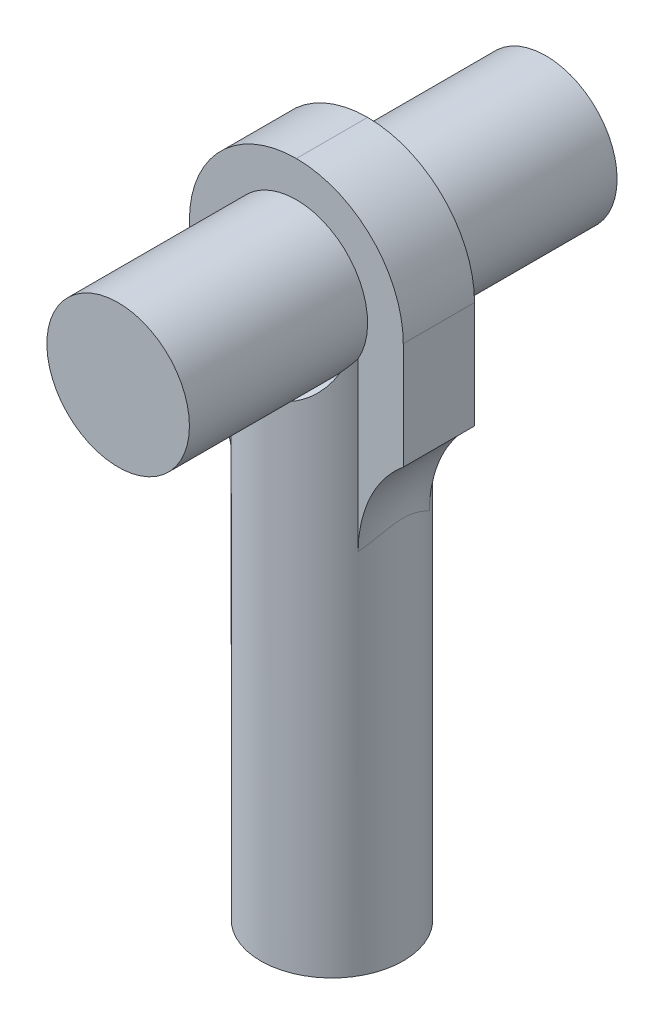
ISO-10303-21;
HEADER;
FILE_DESCRIPTION(('STEP AP214'),'2;1');
FILE_NAME('part.step','',(''),(''),'','','');
FILE_SCHEMA(('AUTOMOTIVE_DESIGN { 1 0 10303 214 1 1 1 1 }'));
ENDSEC;
DATA;
#1=APPLICATION_CONTEXT('core data for automotive mechanical design processes');
#2=APPLICATION_PROTOCOL_DEFINITION('international standard','automotive_design',2000,#1);
#3=PRODUCT_CONTEXT('',#1,'mechanical');
#4=PRODUCT('Part','Part','',(#3));
#5=PRODUCT_RELATED_PRODUCT_CATEGORY('part','',(#4));
#6=PRODUCT_DEFINITION_FORMATION('','',#4);
#7=PRODUCT_DEFINITION_CONTEXT('part definition',#1,'design');
#8=PRODUCT_DEFINITION('design','',#6,#7);
#9=PRODUCT_DEFINITION_SHAPE('','',#8);
#10=(LENGTH_UNIT() NAMED_UNIT(*) SI_UNIT(.MILLI.,.METRE.));
#11=(NAMED_UNIT(*) PLANE_ANGLE_UNIT() SI_UNIT($,.RADIAN.));
#12=(NAMED_UNIT(*) SI_UNIT($,.STERADIAN.) SOLID_ANGLE_UNIT());
#13=UNCERTAINTY_MEASURE_WITH_UNIT(LENGTH_MEASURE(1.E-05),#10,'distance_accuracy_value','');
#14=(GEOMETRIC_REPRESENTATION_CONTEXT(3) GLOBAL_UNCERTAINTY_ASSIGNED_CONTEXT((#13)) GLOBAL_UNIT_ASSIGNED_CONTEXT((#10,
#11,#12)) REPRESENTATION_CONTEXT('',''));
#15=CARTESIAN_POINT('',(0.,0.,0.));
#16=DIRECTION('',(0.,0.,1.));
#17=DIRECTION('',(1.,0.,0.));
#18=AXIS2_PLACEMENT_3D('',#15,#16,#17);
#19=CARTESIAN_POINT('',(15.,0.,5.));
#20=DIRECTION('',(-1.,0.,0.));
#21=DIRECTION('',(0.,0.,1.));
#22=AXIS2_PLACEMENT_3D('',#19,#20,#21);
#23=PLANE('',#22);
#24=DIRECTION('',(0.,1.,0.));
#25=VECTOR('',#24,1.);
#26=CARTESIAN_POINT('',(15.,0.,-5.));
#27=LINE('',#26,#25);
#28=CARTESIAN_POINT('',(15.,-15.,-5.));
#29=VERTEX_POINT('',#28);
#30=CARTESIAN_POINT('',(15.,0.,-5.));
#31=VERTEX_POINT('',#30);
#32=EDGE_CURVE('E348',#29,#31,#27,.T.);
#33=ORIENTED_EDGE('',*,*,#32,.T.);
#34=DIRECTION('',(0.,0.,-1.));
#35=VECTOR('',#34,1.);
#36=CARTESIAN_POINT('',(15.,0.,5.));
#37=LINE('',#36,#35);
#38=CARTESIAN_POINT('',(15.,0.,5.));
#39=VERTEX_POINT('',#38);
#40=EDGE_CURVE('E286',#31,#39,#37,.F.);
#41=ORIENTED_EDGE('',*,*,#40,.T.);
#42=DIRECTION('',(0.,1.,0.));
#43=VECTOR('',#42,1.);
#44=CARTESIAN_POINT('',(15.,0.,5.));
#45=LINE('',#44,#43);
#46=CARTESIAN_POINT('',(15.,-15.,5.));
#47=VERTEX_POINT('',#46);
#48=EDGE_CURVE('E270',#47,#39,#45,.T.);
#49=ORIENTED_EDGE('',*,*,#48,.F.);
#50=DIRECTION('',(0.,0.,-1.));
#51=VECTOR('',#50,1.);
#52=CARTESIAN_POINT('',(15.,-15.,5.));
#53=LINE('',#52,#51);
#54=EDGE_CURVE('E283',#47,#29,#53,.T.);
#55=ORIENTED_EDGE('',*,*,#54,.T.);
#56=EDGE_LOOP('',(#33,#41,#49,#55));
#57=FACE_BOUND('',#56,.T.);
#58=ADVANCED_FACE('F41',(#57),#23,.F.);
#59=CARTESIAN_POINT('',(-15.,0.,5.));
#60=DIRECTION('',(-1.,0.,0.));
#61=DIRECTION('',(0.,0.,1.));
#62=AXIS2_PLACEMENT_3D('',#59,#60,#61);
#63=PLANE('',#62);
#64=DIRECTION('',(0.,1.,0.));
#65=VECTOR('',#64,1.);
#66=CARTESIAN_POINT('',(-15.,0.,5.));
#67=LINE('',#66,#65);
#68=CARTESIAN_POINT('',(-15.,-15.,5.));
#69=VERTEX_POINT('',#68);
#70=CARTESIAN_POINT('',(-15.,0.,5.));
#71=VERTEX_POINT('',#70);
#72=EDGE_CURVE('E287',#69,#71,#67,.T.);
#73=ORIENTED_EDGE('',*,*,#72,.T.);
#74=DIRECTION('',(0.,0.,-1.));
#75=VECTOR('',#74,1.);
#76=CARTESIAN_POINT('',(-15.,0.,5.));
#77=LINE('',#76,#75);
#78=CARTESIAN_POINT('',(-15.,0.,-5.));
#79=VERTEX_POINT('',#78);
#80=EDGE_CURVE('E311',#71,#79,#77,.T.);
#81=ORIENTED_EDGE('',*,*,#80,.T.);
#82=DIRECTION('',(0.,1.,0.));
#83=VECTOR('',#82,1.);
#84=CARTESIAN_POINT('',(-15.,0.,-5.));
#85=LINE('',#84,#83);
#86=CARTESIAN_POINT('',(-15.,-15.,-5.));
#87=VERTEX_POINT('',#86);
#88=EDGE_CURVE('E288',#87,#79,#85,.T.);
#89=ORIENTED_EDGE('',*,*,#88,.F.);
#90=DIRECTION('',(0.,0.,-1.));
#91=VECTOR('',#90,1.);
#92=CARTESIAN_POINT('',(-15.,-15.,5.));
#93=LINE('',#92,#91);
#94=EDGE_CURVE('E291',#69,#87,#93,.T.);
#95=ORIENTED_EDGE('',*,*,#94,.F.);
#96=EDGE_LOOP('',(#73,#81,#89,#95));
#97=FACE_BOUND('',#96,.T.);
#98=ADVANCED_FACE('F246',(#97),#63,.T.);
#99=CARTESIAN_POINT('',(0.,0.,5.));
#100=DIRECTION('',(0.,0.,1.));
#101=DIRECTION('',(1.,0.,0.));
#102=AXIS2_PLACEMENT_3D('',#99,#100,#101);
#103=PLANE('',#102);
#104=CARTESIAN_POINT('',(0.,0.,5.));
#105=DIRECTION('',(0.,0.,1.));
#106=DIRECTION('',(1.,0.,0.));
#107=AXIS2_PLACEMENT_3D('',#104,#105,#106);
#108=CIRCLE('',#107,10.);
#109=CARTESIAN_POINT('',(-8.66025403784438,-5.,5.));
#110=VERTEX_POINT('',#109);
#111=CARTESIAN_POINT('',(8.66025403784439,-5.,5.));
#112=VERTEX_POINT('',#111);
#113=EDGE_CURVE('E344',#110,#112,#108,.F.);
#114=ORIENTED_EDGE('',*,*,#113,.T.);
#115=DIRECTION('',(0.,1.,0.));
#116=VECTOR('',#115,1.);
#117=CARTESIAN_POINT('',(8.66025403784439,-28.4450382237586,5.));
#118=LINE('',#117,#116);
#119=CARTESIAN_POINT('',(8.66025403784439,-28.4450382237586,5.));
#120=VERTEX_POINT('',#119);
#121=EDGE_CURVE('E105',#120,#112,#118,.T.);
#122=ORIENTED_EDGE('',*,*,#121,.F.);
#123=CARTESIAN_POINT('',(7.77408964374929,-29.3292982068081,-6.2899547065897));
#124=CARTESIAN_POINT('',(6.3473229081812,-17.6781885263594,-8.05337161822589));
#125=CARTESIAN_POINT('',(15.,-15.,-15.7248867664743));
#126=CARTESIAN_POINT('',(7.95136143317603,-29.1921049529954,-6.07081218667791));
#127=CARTESIAN_POINT('',(6.51272510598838,-17.9181381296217,-7.95085223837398));
#128=CARTESIAN_POINT('',(15.,-15.,-15.1770304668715));
#129=CARTESIAN_POINT('',(8.11858387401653,-29.0402095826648,-5.84523017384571));
#130=CARTESIAN_POINT('',(6.70492660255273,-18.130349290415,-7.80720851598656));
#131=CARTESIAN_POINT('',(15.,-15.,-14.6130754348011));
#132=CARTESIAN_POINT('',(8.43263725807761,-28.7183911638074,-5.38228419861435));
#133=CARTESIAN_POINT('',(7.11288329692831,-18.4970069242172,-7.44727159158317));
#134=CARTESIAN_POINT('',(15.,-15.,-13.4557104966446));
#135=CARTESIAN_POINT('',(8.57947247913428,-28.548471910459,-5.14492272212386));
#136=CARTESIAN_POINT('',(7.32844635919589,-18.6529215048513,-7.23222608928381));
#137=CARTESIAN_POINT('',(15.,-15.,-12.86230680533));
#138=CARTESIAN_POINT('',(8.85399515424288,-28.2000598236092,-4.65682278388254));
#139=CARTESIAN_POINT('',(7.76164734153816,-18.914242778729,-6.73490387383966));
#140=CARTESIAN_POINT('',(15.,-15.,-11.6420569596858));
#141=CARTESIAN_POINT('',(8.98146076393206,-28.0214946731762,-4.40596830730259));
#142=CARTESIAN_POINT('',(7.9797683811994,-19.0203573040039,-6.45259423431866));
#143=CARTESIAN_POINT('',(15.,-15.,-11.0149207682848));
#144=CARTESIAN_POINT('',(9.21501219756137,-27.6694233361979,-3.89393360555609));
#145=CARTESIAN_POINT('',(8.39818707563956,-19.190093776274,-5.83178031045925));
#146=CARTESIAN_POINT('',(15.,-15.,-9.73483401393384));
#147=CARTESIAN_POINT('',(9.3210995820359,-27.4959167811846,-3.63275413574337));
#148=CARTESIAN_POINT('',(8.59926846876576,-19.2545969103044,-5.49343320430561));
#149=CARTESIAN_POINT('',(15.,-15.,-9.08188533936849));
#150=CARTESIAN_POINT('',(9.49414353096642,-27.1963002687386,-3.14878164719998));
#151=CARTESIAN_POINT('',(8.93719392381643,-19.3435677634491,-4.83451489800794));
#152=CARTESIAN_POINT('',(15.,-15.,-7.87195411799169));
#153=CARTESIAN_POINT('',(9.5647067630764,-27.0672864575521,-2.92756309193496));
#154=CARTESIAN_POINT('',(9.07931127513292,-19.3734056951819,-4.52216991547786));
#155=CARTESIAN_POINT('',(15.,-15.,-7.31890772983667));
#156=CARTESIAN_POINT('',(9.6905931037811,-26.828401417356,-2.47923143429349));
#157=CARTESIAN_POINT('',(9.33697522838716,-19.4182658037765,-3.87144280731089));
#158=CARTESIAN_POINT('',(15.,-15.,-6.19807858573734));
#159=CARTESIAN_POINT('',(9.7459202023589,-26.7185251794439,-2.25211989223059));
#160=CARTESIAN_POINT('',(9.45301423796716,-19.4334651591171,-3.53265301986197));
#161=CARTESIAN_POINT('',(15.,-15.,-5.6302997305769));
#162=CARTESIAN_POINT('',(9.84050441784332,-26.5255817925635,-1.79410952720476));
#163=CARTESIAN_POINT('',(9.65330531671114,-19.4546381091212,-2.83669771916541));
#164=CARTESIAN_POINT('',(15.,-15.,-4.48527381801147));
#165=CARTESIAN_POINT('',(9.87985011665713,-26.4423674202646,-1.5632391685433));
#166=CARTESIAN_POINT('',(9.7381423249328,-19.4607445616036,-2.47905961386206));
#167=CARTESIAN_POINT('',(15.,-15.,-3.90809792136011));
#168=CARTESIAN_POINT('',(9.94233010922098,-26.3081128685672,-1.09780782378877));
#169=CARTESIAN_POINT('',(9.87342768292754,-19.4684849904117,-1.75021646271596));
#170=CARTESIAN_POINT('',(15.,-15.,-2.74451955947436));
#171=CARTESIAN_POINT('',(9.96546541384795,-26.2570706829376,-0.863247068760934));
#172=CARTESIAN_POINT('',(9.92417882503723,-19.4701473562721,-1.37825846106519));
#173=CARTESIAN_POINT('',(15.,-15.,-2.15811767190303));
#174=CARTESIAN_POINT('',(9.99520950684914,-26.1911551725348,-0.390331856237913));
#175=CARTESIAN_POINT('',(9.98938693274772,-19.4720143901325,-0.625141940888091));
#176=CARTESIAN_POINT('',(15.,-15.,-0.97582964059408));
#177=CARTESIAN_POINT('',(10.0016830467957,-26.1765778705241,-0.151962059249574));
#178=CARTESIAN_POINT('',(10.0037014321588,-19.4722124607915,-0.24305128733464));
#179=CARTESIAN_POINT('',(15.,-15.,-0.379905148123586));
#180=CARTESIAN_POINT('',(9.99757267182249,-26.1857660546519,0.324503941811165));
#181=CARTESIAN_POINT('',(9.99465990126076,-19.4720260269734,0.519219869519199));
#182=CARTESIAN_POINT('',(15.,-15.,0.81125985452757));
#183=CARTESIAN_POINT('',(9.98698896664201,-26.2095310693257,0.562600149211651));
#184=CARTESIAN_POINT('',(9.97128267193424,-19.4716411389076,0.900311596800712));
#185=CARTESIAN_POINT('',(15.,-15.,1.40650037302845));
#186=CARTESIAN_POINT('',(9.94892835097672,-26.2934154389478,1.03715025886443));
#187=CARTESIAN_POINT('',(9.88802032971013,-19.4688346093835,1.65382000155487));
#188=CARTESIAN_POINT('',(15.,-15.,2.59287564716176));
#189=CARTESIAN_POINT('',(9.92139722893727,-26.3536514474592,1.27359641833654));
#190=CARTESIAN_POINT('',(9.82782183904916,-19.4663976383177,2.02706795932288));
#191=CARTESIAN_POINT('',(15.,-15.,3.18399104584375));
#192=CARTESIAN_POINT('',(9.84989797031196,-26.5055604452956,1.742342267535));
#193=CARTESIAN_POINT('',(9.67373545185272,-19.4559641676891,2.7564630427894));
#194=CARTESIAN_POINT('',(15.,-15.,4.35585566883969));
#195=CARTESIAN_POINT('',(9.80592658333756,-26.5972396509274,1.97464112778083));
#196=CARTESIAN_POINT('',(9.57949627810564,-19.447926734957,3.11334941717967));
#197=CARTESIAN_POINT('',(15.,-15.,4.93660281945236));
#198=CARTESIAN_POINT('',(9.6927565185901,-26.8241573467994,2.47543497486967));
#199=CARTESIAN_POINT('',(9.34153801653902,-19.4189238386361,3.86684241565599));
#200=CARTESIAN_POINT('',(15.,-15.,6.18858743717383));
#201=CARTESIAN_POINT('',(9.62043137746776,-26.9642775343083,2.74286663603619));
#202=CARTESIAN_POINT('',(9.19144338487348,-19.3957412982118,4.25921890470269));
#203=CARTESIAN_POINT('',(15.,-15.,6.85716659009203));
#204=CARTESIAN_POINT('',(9.45461050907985,-27.2668726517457,3.26901967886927));
#205=CARTESIAN_POINT('',(8.85870982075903,-19.3252752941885,5.00271901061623));
#206=CARTESIAN_POINT('',(15.,-15.,8.17254919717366));
#207=CARTESIAN_POINT('',(9.3611074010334,-27.4293553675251,3.52773798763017));
#208=CARTESIAN_POINT('',(8.67522208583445,-19.277604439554,5.35436413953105));
#209=CARTESIAN_POINT('',(15.,-15.,8.81934496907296));
#210=CARTESIAN_POINT('',(9.15363979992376,-27.7646504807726,4.0356036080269));
#211=CARTESIAN_POINT('',(8.286598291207,-19.1482919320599,6.00833707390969));
#212=CARTESIAN_POINT('',(15.,-15.,10.0890090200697));
#213=CARTESIAN_POINT('',(9.03968153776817,-27.9374597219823,4.28475380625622));
#214=CARTESIAN_POINT('',(8.08066870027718,-19.0660032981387,6.31077352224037));
#215=CARTESIAN_POINT('',(15.,-15.,10.7118845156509));
#216=CARTESIAN_POINT('',(8.79167665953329,-28.2821967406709,4.77298679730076));
#217=CARTESIAN_POINT('',(7.66085894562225,-18.8580875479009,6.85869851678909));
#218=CARTESIAN_POINT('',(15.,-15.,11.93246699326));
#219=CARTESIAN_POINT('',(8.65762763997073,-28.4541244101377,5.01206838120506));
#220=CARTESIAN_POINT('',(7.44638466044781,-18.7314770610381,7.10378497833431));
#221=CARTESIAN_POINT('',(15.,-15.,12.5301709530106));
#222=CARTESIAN_POINT('',(8.36678500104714,-28.7896005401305,5.48409300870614));
#223=CARTESIAN_POINT('',(7.02329461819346,-18.4240047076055,7.53353914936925));
#224=CARTESIAN_POINT('',(15.,-15.,13.7102325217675));
#225=CARTESIAN_POINT('',(8.20958769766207,-28.9529105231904,5.71681546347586));
#226=CARTESIAN_POINT('',(6.81478993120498,-18.2408083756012,7.7158456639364));
#227=CARTESIAN_POINT('',(15.,-15.,14.2920386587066));
#228=CARTESIAN_POINT('',(7.87493960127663,-29.25575799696,6.16964665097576));
#229=CARTESIAN_POINT('',(6.43383910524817,-17.8168547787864,8.00560632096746));
#230=CARTESIAN_POINT('',(15.,-15.,15.4241166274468));
#231=CARTESIAN_POINT('',(7.69750230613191,-29.3953111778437,6.38976364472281));
#232=CARTESIAN_POINT('',(6.26193669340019,-17.5745640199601,8.11160866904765));
#233=CARTESIAN_POINT('',(15.,-15.,15.97440911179));
#234=CARTESIAN_POINT('',(7.3220363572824,-29.6394079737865,6.81680512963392));
#235=CARTESIAN_POINT('',(5.98591350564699,-17.0336125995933,8.24499754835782));
#236=CARTESIAN_POINT('',(15.,-15.,17.0420128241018));
#237=CARTESIAN_POINT('',(7.12393154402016,-29.743815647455,7.0236759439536));
#238=CARTESIAN_POINT('',(5.88368163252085,-16.7332923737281,8.27017176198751));
#239=CARTESIAN_POINT('',(15.,-15.,17.5591898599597));
#240=CARTESIAN_POINT('',(6.81253428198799,-29.8641481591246,7.32189402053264));
#241=CARTESIAN_POINT('',(5.8109654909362,-16.2547760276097,8.25105392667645));
#242=CARTESIAN_POINT('',(15.,-15.,18.3047350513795));
#243=CARTESIAN_POINT('',(6.70620331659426,-29.8982346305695,7.41941309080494));
#244=CARTESIAN_POINT('',(5.80049436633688,-16.0887405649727,8.23472578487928));
#245=CARTESIAN_POINT('',(15.,-15.,18.5485327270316));
#246=CARTESIAN_POINT('',(6.48905405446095,-29.9525777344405,7.61006404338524));
#247=CARTESIAN_POINT('',(5.81143986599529,-15.7498890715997,8.18459584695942));
#248=CARTESIAN_POINT('',(15.,-15.,19.025160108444));
#249=CARTESIAN_POINT('',(6.37823374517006,-29.9728280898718,7.70319391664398));
#250=CARTESIAN_POINT('',(5.83326348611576,-15.5770537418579,8.15057984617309));
#251=CARTESIAN_POINT('',(15.,-15.,19.2579847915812));
#252=CARTESIAN_POINT('',(6.2653113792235,-29.9853282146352,7.79396390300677));
#253=CARTESIAN_POINT('',(5.87325864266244,-15.4039665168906,8.10912221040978));
#254=CARTESIAN_POINT('',(15.,-15.,19.4849097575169));
#255=(BOUNDED_SURFACE() B_SPLINE_SURFACE(3,2,((#123,#124,#125),(#126,#127,#128),(#129,#130,
#131),(#132,#133,#134),(#135,#136,#137),(#138,#139,#140),(#141,#142,#143),(#144,#145,#146),
(#147,#148,#149),(#150,#151,#152),(#153,#154,#155),(#156,#157,#158),(#159,#160,#161),(#162,#163,
#164),(#165,#166,#167),(#168,#169,#170),(#171,#172,#173),(#174,#175,#176),(#177,#178,#179),
(#180,#181,#182),(#183,#184,#185),(#186,#187,#188),(#189,#190,#191),(#192,#193,#194),(#195,#196,
#197),(#198,#199,#200),(#201,#202,#203),(#204,#205,#206),(#207,#208,#209),(#210,#211,#212),
(#213,#214,#215),(#216,#217,#218),(#219,#220,#221),(#222,#223,#224),(#225,#226,#227),(#228,#229,
#230),(#231,#232,#233),(#234,#235,#236),(#237,#238,#239),(#240,#241,#242),(#243,#244,#245),
(#246,#247,#248),(#249,#250,#251),(#252,#253,#254)),.UNSPECIFIED.,.F.,.F.,
.F.) B_SPLINE_SURFACE_WITH_KNOTS((4,2,2,2,2,2,2,2,2,2,2,2,2,2,2,2,2,2,2,2,2,4),(3,3),(0.,
2.15235030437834,4.30424829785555,6.47918628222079,8.65396544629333,10.4364334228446,
12.218434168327,13.9904182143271,15.7622917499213,17.5485033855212,19.3346930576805,
21.1266263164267,22.9189140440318,25.0357734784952,27.1533718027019,29.2703261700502,
31.3875339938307,33.5473800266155,35.705794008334,37.8724632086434,38.958837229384,
40.0457037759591),(0.,1.),
.UNSPECIFIED.) GEOMETRIC_REPRESENTATION_ITEM() RATIONAL_B_SPLINE_SURFACE(((1.,0.784176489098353,
1.),(1.,0.793181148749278,1.),(1.,0.802000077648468,1.),(1.,0.81902909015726,1.),(1.,
0.827239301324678,1.),(1.,0.842900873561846,1.),(1.,0.850343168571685,1.),(1.,0.864187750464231,
1.),(1.,0.87059011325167,1.),(1.,0.881147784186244,1.),(1.,0.885500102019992,1.),(1.,
0.893317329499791,1.),(1.,0.896782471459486,1.),(1.,0.902733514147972,1.),(1.,0.905224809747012,
1.),(1.,0.909191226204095,1.),(1.,0.910666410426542,1.),(1.,0.912564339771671,1.),(1.,
0.912978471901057,1.),(1.,0.912715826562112,1.),(1.,0.912039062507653,1.),(1.,0.909612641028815,
1.),(1.,0.907859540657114,1.),(1.,0.90332922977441,1.),(1.,0.900551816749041,1.),(1.,
0.893453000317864,1.),(1.,0.888943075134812,1.),(1.,0.87872186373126,1.),(1.,0.873010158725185,
1.),(1.,0.860528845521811,1.),(1.,0.853759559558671,1.),(1.,0.839317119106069,1.),(1.,
0.831643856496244,1.),(1.,0.815418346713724,1.),(1.,0.806851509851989,1.),(1.,0.789231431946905,
1.),(1.,0.780178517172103,1.),(1.,0.761876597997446,1.),(1.,0.752626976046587,1.),(1.,
0.738958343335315,1.),(1.,0.734430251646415,1.),(1.,0.725511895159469,1.),(1.,0.72112169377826,
1.),(1.,0.716834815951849,1.))) REPRESENTATION_ITEM('') SURFACE());
#256=CARTESIAN_POINT('',(8.66025403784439,-28.4450382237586,5.));
#257=CARTESIAN_POINT('',(8.66026469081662,-28.1978138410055,5.));
#258=CARTESIAN_POINT('',(8.66638176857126,-27.9506207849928,5.));
#259=CARTESIAN_POINT('',(8.69024938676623,-27.4568504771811,5.));
#260=CARTESIAN_POINT('',(8.70799720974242,-27.2102730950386,5.));
#261=CARTESIAN_POINT('',(8.75452885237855,-26.7183682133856,5.));
#262=CARTESIAN_POINT('',(8.78330383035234,-26.4730398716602,5.));
#263=CARTESIAN_POINT('',(8.85139648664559,-25.9838533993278,5.));
#264=CARTESIAN_POINT('',(8.89071489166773,-25.7399953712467,5.));
#265=CARTESIAN_POINT('',(9.02405354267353,-25.0100070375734,5.));
#266=CARTESIAN_POINT('',(9.13334713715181,-24.5265880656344,5.));
#267=CARTESIAN_POINT('',(9.39027647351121,-23.5700047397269,5.));
#268=CARTESIAN_POINT('',(9.53792284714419,-23.0968432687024,5.));
#269=CARTESIAN_POINT('',(9.86995405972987,-22.1650504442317,5.));
#270=CARTESIAN_POINT('',(10.054235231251,-21.7063822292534,5.));
#271=CARTESIAN_POINT('',(10.4591749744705,-20.8054141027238,5.));
#272=CARTESIAN_POINT('',(10.6798311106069,-20.363113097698,5.));
#273=CARTESIAN_POINT('',(11.1565252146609,-19.4991540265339,5.));
#274=CARTESIAN_POINT('',(11.4124886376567,-19.0774549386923,5.));
#275=CARTESIAN_POINT('',(11.9592070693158,-18.2574521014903,5.));
#276=CARTESIAN_POINT('',(12.2499517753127,-17.8591414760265,5.));
#277=CARTESIAN_POINT('',(12.9199386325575,-17.0207861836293,5.));
#278=CARTESIAN_POINT('',(13.3057242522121,-16.5859136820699,5.));
#279=CARTESIAN_POINT('',(13.9170482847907,-15.9660573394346,5.));
#280=CARTESIAN_POINT('',(14.1263233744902,-15.7647985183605,5.));
#281=CARTESIAN_POINT('',(14.5553897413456,-15.3736794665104,5.));
#282=CARTESIAN_POINT('',(14.7751844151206,-15.1838229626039,5.));
#283=CARTESIAN_POINT('',(15.,-15.,5.));
#284=B_SPLINE_CURVE_WITH_KNOTS('',3,(#256,#257,#258,#259,#260,#261,#262,#263,#264,#265,#266,
#267,#268,#269,#270,#271,#272,#273,#274,#275,#276,#277,#278,#279,#280,#281,#282,#283),
.UNSPECIFIED.,.F.,.F.,(4,2,2,2,2,2,2,2,2,2,2,2,2,4),(0.,0.741551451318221,1.48292970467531,
2.22371475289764,2.96455087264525,4.44960517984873,5.93507159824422,7.41639286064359,
8.8976149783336,10.375756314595,11.8534608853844,13.5939123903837,14.4645973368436,
15.3355653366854),.UNSPECIFIED.);
#285=EDGE_CURVE('E236',#120,#47,#284,.T.);
#286=ORIENTED_EDGE('',*,*,#285,.T.);
#287=ORIENTED_EDGE('',*,*,#48,.T.);
#288=CARTESIAN_POINT('',(0.,0.,5.));
#289=DIRECTION('',(0.,0.,1.));
#290=DIRECTION('',(1.,0.,0.));
#291=AXIS2_PLACEMENT_3D('',#288,#289,#290);
#292=CIRCLE('',#291,15.);
#293=CARTESIAN_POINT('',(0.,15.,5.));
#294=VERTEX_POINT('',#293);
#295=EDGE_CURVE('E309',#39,#294,#292,.T.);
#296=ORIENTED_EDGE('',*,*,#295,.T.);
#297=CARTESIAN_POINT('',(0.,0.,5.));
#298=DIRECTION('',(0.,0.,1.));
#299=DIRECTION('',(1.,0.,0.));
#300=AXIS2_PLACEMENT_3D('',#297,#298,#299);
#301=CIRCLE('',#300,15.);
#302=EDGE_CURVE('E306',#294,#71,#301,.T.);
#303=ORIENTED_EDGE('',*,*,#302,.T.);
#304=ORIENTED_EDGE('',*,*,#72,.F.);
#305=CARTESIAN_POINT('',(-7.77408964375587,-29.329298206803,6.28995470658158));
#306=CARTESIAN_POINT('',(-6.34732290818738,-17.6781885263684,8.05337161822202));
#307=CARTESIAN_POINT('',(-15.,-15.,15.724886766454));
#308=CARTESIAN_POINT('',(-7.95136143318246,-29.1921049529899,6.07081218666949));
#309=CARTESIAN_POINT('',(-6.51272510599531,-17.9181381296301,7.9508522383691));
#310=CARTESIAN_POINT('',(-15.,-15.,15.1770304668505));
#311=CARTESIAN_POINT('',(-8.11858387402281,-29.0402095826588,5.84523017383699));
#312=CARTESIAN_POINT('',(-6.70492660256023,-18.1303492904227,7.80720851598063));
#313=CARTESIAN_POINT('',(-15.,-15.,14.6130754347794));
#314=CARTESIAN_POINT('',(-8.43263725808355,-28.7183911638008,5.38228419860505));
#315=CARTESIAN_POINT('',(-7.11288329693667,-18.4970069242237,7.44727159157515));
#316=CARTESIAN_POINT('',(-15.,-15.,13.4557104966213));
#317=CARTESIAN_POINT('',(-8.57947247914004,-28.5484719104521,5.14492272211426));
#318=CARTESIAN_POINT('',(-7.32844635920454,-18.6529215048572,7.23222608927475));
#319=CARTESIAN_POINT('',(-15.,-15.,12.862306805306));
#320=CARTESIAN_POINT('',(-8.85399515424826,-28.2000598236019,4.65682278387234));
#321=CARTESIAN_POINT('',(-7.76164734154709,-18.9142427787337,6.73490387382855));
#322=CARTESIAN_POINT('',(-15.,-15.,11.6420569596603));
#323=CARTESIAN_POINT('',(-8.98146076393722,-28.0214946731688,4.40596830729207));
#324=CARTESIAN_POINT('',(-7.97976838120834,-19.020357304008,6.45259423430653));
#325=CARTESIAN_POINT('',(-15.,-15.,11.0149207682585));
#326=CARTESIAN_POINT('',(-9.21501219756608,-27.6694233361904,3.89393360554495));
#327=CARTESIAN_POINT('',(-8.3981870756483,-19.190093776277,5.83178031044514));
#328=CARTESIAN_POINT('',(-15.,-15.,9.73483401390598));
#329=CARTESIAN_POINT('',(-9.32109958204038,-27.4959167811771,3.63275413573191));
#330=CARTESIAN_POINT('',(-8.5992684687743,-19.254596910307,5.49343320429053));
#331=CARTESIAN_POINT('',(-15.,-15.,9.08188533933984));
#332=CARTESIAN_POINT('',(-9.49414353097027,-27.1963002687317,3.14878164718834));
#333=CARTESIAN_POINT('',(-8.93719392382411,-19.3435677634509,4.83451489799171));
#334=CARTESIAN_POINT('',(-15.,-15.,7.87195411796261));
#335=CARTESIAN_POINT('',(-9.56470676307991,-27.0672864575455,2.92756309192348));
#336=CARTESIAN_POINT('',(-9.07931127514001,-19.3734056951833,4.52216991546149));
#337=CARTESIAN_POINT('',(-15.,-15.,7.31890772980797));
#338=CARTESIAN_POINT('',(-9.69059310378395,-26.8284014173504,2.47923143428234));
#339=CARTESIAN_POINT('',(-9.33697522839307,-19.4182658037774,3.87144280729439));
#340=CARTESIAN_POINT('',(-15.,-15.,6.19807858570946));
#341=CARTESIAN_POINT('',(-9.74592020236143,-26.7185251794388,2.25211989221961));
#342=CARTESIAN_POINT('',(-9.45301423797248,-19.4334651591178,3.53265301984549));
#343=CARTESIAN_POINT('',(-15.,-15.,5.63029973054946));
#344=CARTESIAN_POINT('',(-9.84050441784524,-26.5255817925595,1.79410952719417));
#345=CARTESIAN_POINT('',(-9.65330531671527,-19.4546381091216,2.83669771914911));
#346=CARTESIAN_POINT('',(-15.,-15.,4.48527381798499));
#347=CARTESIAN_POINT('',(-9.87985011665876,-26.4423674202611,1.56323916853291));
#348=CARTESIAN_POINT('',(-9.73814232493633,-19.4607445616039,2.47905961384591));
#349=CARTESIAN_POINT('',(-15.,-15.,3.90809792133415));
#350=CARTESIAN_POINT('',(-9.94233010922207,-26.3081128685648,1.09780782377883));
#351=CARTESIAN_POINT('',(-9.87342768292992,-19.4684849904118,1.75021646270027));
#352=CARTESIAN_POINT('',(-15.,-15.,2.74451955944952));
#353=CARTESIAN_POINT('',(-9.96546541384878,-26.2570706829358,0.863247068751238));
#354=CARTESIAN_POINT('',(-9.92417882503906,-19.4701473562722,1.3782584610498));
#355=CARTESIAN_POINT('',(-15.,-15.,2.15811767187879));
#356=CARTESIAN_POINT('',(-9.9952095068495,-26.191155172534,0.390331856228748));
#357=CARTESIAN_POINT('',(-9.98938693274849,-19.4720143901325,0.625141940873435));
#358=CARTESIAN_POINT('',(-15.,-15.,0.975829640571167));
#359=CARTESIAN_POINT('',(-10.0016830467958,-26.1765778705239,0.151962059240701));
#360=CARTESIAN_POINT('',(-10.003701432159,-19.4722124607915,0.243051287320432));
#361=CARTESIAN_POINT('',(-15.,-15.,0.379905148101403));
#362=CARTESIAN_POINT('',(-9.99757267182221,-26.1857660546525,-0.324503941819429));
#363=CARTESIAN_POINT('',(-9.99465990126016,-19.4720260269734,-0.51921986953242));
#364=CARTESIAN_POINT('',(-15.,-15.,-0.811259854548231));
#365=CARTESIAN_POINT('',(-9.98698896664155,-26.2095310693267,-0.562600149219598));
#366=CARTESIAN_POINT('',(-9.97128267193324,-19.4716411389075,-0.90031159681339));
#367=CARTESIAN_POINT('',(-15.,-15.,-1.40650037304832));
#368=CARTESIAN_POINT('',(-9.94892835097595,-26.2934154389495,-1.03715025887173));
#369=CARTESIAN_POINT('',(-9.88802032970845,-19.4688346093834,-1.65382000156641));
#370=CARTESIAN_POINT('',(-15.,-15.,-2.59287564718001));
#371=CARTESIAN_POINT('',(-9.92139722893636,-26.3536514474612,-1.27359641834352));
#372=CARTESIAN_POINT('',(-9.8278218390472,-19.4663976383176,-2.02706795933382));
#373=CARTESIAN_POINT('',(-15.,-15.,-3.18399104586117));
#374=CARTESIAN_POINT('',(-9.84989797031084,-26.5055604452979,-1.74234226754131));
#375=CARTESIAN_POINT('',(-9.67373545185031,-19.4559641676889,-2.75646304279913));
#376=CARTESIAN_POINT('',(-15.,-15.,-4.35585566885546));
#377=CARTESIAN_POINT('',(-9.80592658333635,-26.5972396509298,-1.9746411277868));
#378=CARTESIAN_POINT('',(-9.57949627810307,-19.4479267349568,-3.11334941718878));
#379=CARTESIAN_POINT('',(-15.,-15.,-4.93660281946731));
#380=CARTESIAN_POINT('',(-9.69275651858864,-26.8241573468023,-2.4754349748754));
#381=CARTESIAN_POINT('',(-9.34153801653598,-19.4189238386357,-3.86684241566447));
#382=CARTESIAN_POINT('',(-15.,-15.,-6.18858743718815));
#383=CARTESIAN_POINT('',(-9.62043137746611,-26.9642775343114,-2.74286663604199));
#384=CARTESIAN_POINT('',(-9.19144338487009,-19.3957412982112,-4.2592189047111));
#385=CARTESIAN_POINT('',(-15.,-15.,-6.85716659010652));
#386=CARTESIAN_POINT('',(-9.45461050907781,-27.2668726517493,-3.26901967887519));
#387=CARTESIAN_POINT('',(-8.85870982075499,-19.3252752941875,-5.00271901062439));
#388=CARTESIAN_POINT('',(-15.,-15.,-8.17254919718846));
#389=CARTESIAN_POINT('',(-9.36110740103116,-27.4293553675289,-3.52773798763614));
#390=CARTESIAN_POINT('',(-8.67522208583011,-19.2776044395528,-5.35436413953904));
#391=CARTESIAN_POINT('',(-15.,-15.,-8.81934496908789));
#392=CARTESIAN_POINT('',(-9.15363979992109,-27.7646504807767,-4.03560360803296));
#393=CARTESIAN_POINT('',(-8.28659829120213,-19.148291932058,-6.00833707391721));
#394=CARTESIAN_POINT('',(-15.,-15.,-10.0890090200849));
#395=CARTESIAN_POINT('',(-9.03968153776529,-27.9374597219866,-4.28475380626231));
#396=CARTESIAN_POINT('',(-8.08066870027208,-19.0660032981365,-6.3107735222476));
#397=CARTESIAN_POINT('',(-15.,-15.,-10.7118845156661));
#398=CARTESIAN_POINT('',(-8.79167665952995,-28.2821967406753,-4.77298679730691));
#399=CARTESIAN_POINT('',(-7.66085894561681,-18.8580875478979,-6.85869851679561));
#400=CARTESIAN_POINT('',(-15.,-15.,-11.9324669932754));
#401=CARTESIAN_POINT('',(-8.65762763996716,-28.4541244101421,-5.01206838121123));
#402=CARTESIAN_POINT('',(-7.44638466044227,-18.7314770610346,-7.10378497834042));
#403=CARTESIAN_POINT('',(-15.,-15.,-12.530170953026));
#404=CARTESIAN_POINT('',(-8.3667850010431,-28.7896005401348,-5.4840930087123));
#405=CARTESIAN_POINT('',(-7.02329461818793,-18.424004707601,-7.53353914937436));
#406=CARTESIAN_POINT('',(-15.,-15.,-13.7102325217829));
#407=CARTESIAN_POINT('',(-8.20958769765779,-28.9529105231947,-5.716815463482));
#408=CARTESIAN_POINT('',(-6.81478993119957,-18.2408083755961,-7.71584566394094));
#409=CARTESIAN_POINT('',(-15.,-15.,-14.2920386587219));
#410=CARTESIAN_POINT('',(-7.87493960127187,-29.2557579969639,-6.16964665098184));
#411=CARTESIAN_POINT('',(-6.43383910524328,-17.8168547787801,-8.00560632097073));
#412=CARTESIAN_POINT('',(-15.,-15.,-15.424116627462));
#413=CARTESIAN_POINT('',(-7.6975023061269,-29.3953111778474,-6.38976364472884));
#414=CARTESIAN_POINT('',(-6.26193669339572,-17.5745640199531,-8.11160866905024));
#415=CARTESIAN_POINT('',(-15.,-15.,-15.9744091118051));
#416=CARTESIAN_POINT('',(-7.32203635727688,-29.6394079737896,-6.81680512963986));
#417=CARTESIAN_POINT('',(-5.98591350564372,-17.0336125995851,-8.24499754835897));
#418=CARTESIAN_POINT('',(-15.,-15.,-17.0420128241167));
#419=CARTESIAN_POINT('',(-7.12393154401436,-29.7438156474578,-7.02367594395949));
#420=CARTESIAN_POINT('',(-5.88368163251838,-16.7332923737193,-8.27017176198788));
#421=CARTESIAN_POINT('',(-15.,-15.,-17.5591898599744));
#422=CARTESIAN_POINT('',(-6.81253428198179,-29.8641481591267,-7.32189402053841));
#423=CARTESIAN_POINT('',(-5.81096549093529,-16.2547760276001,-8.2510539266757));
#424=CARTESIAN_POINT('',(-15.,-15.,-18.3047350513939));
#425=CARTESIAN_POINT('',(-6.70620331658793,-29.8982346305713,-7.41941309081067));
#426=CARTESIAN_POINT('',(-5.80049436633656,-16.0887405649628,-8.23472578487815));
#427=CARTESIAN_POINT('',(-15.,-15.,-18.5485327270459));
#428=CARTESIAN_POINT('',(-6.48905405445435,-29.9525777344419,-7.61006404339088));
#429=CARTESIAN_POINT('',(-5.81143986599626,-15.7498890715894,-8.18459584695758));
#430=CARTESIAN_POINT('',(-15.,-15.,-19.0251601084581));
#431=CARTESIAN_POINT('',(-6.37823374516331,-29.9728280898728,-7.70319391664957));
#432=CARTESIAN_POINT('',(-5.83326348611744,-15.5770537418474,-8.15057984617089));
#433=CARTESIAN_POINT('',(-15.,-15.,-19.2579847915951));
#434=CARTESIAN_POINT('',(-6.26531137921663,-29.9853282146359,-7.7939639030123));
#435=CARTESIAN_POINT('',(-5.87325864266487,-15.40396651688,-8.10912221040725));
#436=CARTESIAN_POINT('',(-15.,-15.,-19.4849097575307));
#437=(BOUNDED_SURFACE() B_SPLINE_SURFACE(3,2,((#305,#306,#307),(#308,#309,#310),(#311,#312,
#313),(#314,#315,#316),(#317,#318,#319),(#320,#321,#322),(#323,#324,#325),(#326,#327,#328),
(#329,#330,#331),(#332,#333,#334),(#335,#336,#337),(#338,#339,#340),(#341,#342,#343),(#344,#345,
#346),(#347,#348,#349),(#350,#351,#352),(#353,#354,#355),(#356,#357,#358),(#359,#360,#361),
(#362,#363,#364),(#365,#366,#367),(#368,#369,#370),(#371,#372,#373),(#374,#375,#376),(#377,#378,
#379),(#380,#381,#382),(#383,#384,#385),(#386,#387,#388),(#389,#390,#391),(#392,#393,#394),
(#395,#396,#397),(#398,#399,#400),(#401,#402,#403),(#404,#405,#406),(#407,#408,#409),(#410,#411,
#412),(#413,#414,#415),(#416,#417,#418),(#419,#420,#421),(#422,#423,#424),(#425,#426,#427),
(#428,#429,#430),(#431,#432,#433),(#434,#435,#436)),.UNSPECIFIED.,.F.,.F.,
.F.) B_SPLINE_SURFACE_WITH_KNOTS((4,2,2,2,2,2,2,2,2,2,2,2,2,2,2,2,2,2,2,2,2,4),(3,3),(0.,
2.15235030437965,4.30424829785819,6.47918628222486,8.65396544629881,10.4364334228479,
12.2184341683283,13.9904182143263,15.7622917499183,17.548503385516,19.3346930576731,
21.126626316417,22.9189140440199,25.0357734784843,27.1533718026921,29.2703261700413,
31.3875339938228,33.5473800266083,35.7057940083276,37.8724632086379,38.958837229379,
40.0457037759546),(0.,1.),
.UNSPECIFIED.) GEOMETRIC_REPRESENTATION_ITEM() RATIONAL_B_SPLINE_SURFACE(((1.,0.784176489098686,
1.),(1.,0.793181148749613,1.),(1.,0.802000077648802,1.),(1.,0.819029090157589,1.),(1.,
0.827239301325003,1.),(1.,0.842900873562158,1.),(1.,0.850343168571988,1.),(1.,0.864187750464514,
1.),(1.,0.870590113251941,1.),(1.,0.881147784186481,1.),(1.,0.885500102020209,1.),(1.,
0.893317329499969,1.),(1.,0.896782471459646,1.),(1.,0.902733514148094,1.),(1.,0.905224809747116,
1.),(1.,0.909191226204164,1.),(1.,0.910666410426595,1.),(1.,0.912564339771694,1.),(1.,
0.912978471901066,1.),(1.,0.912715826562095,1.),(1.,0.912039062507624,1.),(1.,0.909612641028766,
1.),(1.,0.907859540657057,1.),(1.,0.903329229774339,1.),(1.,0.900551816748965,1.),(1.,
0.893453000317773,1.),(1.,0.88894307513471,1.),(1.,0.878721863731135,1.),(1.,0.873010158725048,
1.),(1.,0.860528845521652,1.),(1.,0.853759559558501,1.),(1.,0.839317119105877,1.),(1.,
0.831643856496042,1.),(1.,0.815418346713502,1.),(1.,0.806851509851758,1.),(1.,0.78923143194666,
1.),(1.,0.780178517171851,1.),(1.,0.761876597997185,1.),(1.,0.752626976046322,1.),(1.,
0.738958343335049,1.),(1.,0.734430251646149,1.),(1.,0.725511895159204,1.),(1.,0.721121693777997,
1.),(1.,0.716834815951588,1.))) REPRESENTATION_ITEM('') SURFACE());
#438=CARTESIAN_POINT('',(-15.,-15.,5.));
#439=CARTESIAN_POINT('',(-14.8138149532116,-15.152233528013,5.));
#440=CARTESIAN_POINT('',(-14.6310655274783,-15.3086135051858,5.));
#441=CARTESIAN_POINT('',(-14.2726895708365,-15.6293137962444,5.));
#442=CARTESIAN_POINT('',(-14.097062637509,-15.7936336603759,5.));
#443=CARTESIAN_POINT('',(-13.5814648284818,-16.2977536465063,5.));
#444=CARTESIAN_POINT('',(-13.2525024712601,-16.648939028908,5.));
#445=CARTESIAN_POINT('',(-12.6265002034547,-17.3776520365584,5.));
#446=CARTESIAN_POINT('',(-12.3294130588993,-17.7551392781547,5.));
#447=CARTESIAN_POINT('',(-11.7678545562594,-18.5336805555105,5.));
#448=CARTESIAN_POINT('',(-11.503386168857,-18.9347367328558,5.));
#449=CARTESIAN_POINT('',(-11.0086642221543,-19.7559746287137,5.));
#450=CARTESIAN_POINT('',(-10.7783242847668,-20.176104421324,5.));
#451=CARTESIAN_POINT('',(-10.3515989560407,-21.0332738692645,5.));
#452=CARTESIAN_POINT('',(-10.1552154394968,-21.4703144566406,5.));
#453=CARTESIAN_POINT('',(-9.79694236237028,-22.3581428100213,5.));
#454=CARTESIAN_POINT('',(-9.63504324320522,-22.8089267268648,5.));
#455=CARTESIAN_POINT('',(-9.34637797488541,-23.7215689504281,5.));
#456=CARTESIAN_POINT('',(-9.2196058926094,-24.1834253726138,5.));
#457=CARTESIAN_POINT('',(-9.03870735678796,-24.9606532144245,5.));
#458=CARTESIAN_POINT('',(-8.97443966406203,-25.2736975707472,5.));
#459=CARTESIAN_POINT('',(-8.86293159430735,-25.9027264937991,5.));
#460=CARTESIAN_POINT('',(-8.81568576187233,-26.218710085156,5.));
#461=CARTESIAN_POINT('',(-8.73919452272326,-26.8523904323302,5.));
#462=CARTESIAN_POINT('',(-8.70992217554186,-27.1700839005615,5.));
#463=CARTESIAN_POINT('',(-8.67045688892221,-27.8068371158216,5.));
#464=CARTESIAN_POINT('',(-8.66027561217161,-28.1258975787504,5.));
#465=CARTESIAN_POINT('',(-8.6602540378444,-28.4450382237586,5.));
#466=B_SPLINE_CURVE_WITH_KNOTS('',3,(#438,#439,#440,#441,#442,#443,#444,#445,#446,#447,#448,
#449,#450,#451,#452,#453,#454,#455,#456,#457,#458,#459,#460,#461,#462,#463,#464,#465),
.UNSPECIFIED.,.F.,.F.,(4,2,2,2,2,2,2,2,2,2,2,2,2,4),(0.,0.721370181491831,1.44269954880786,
2.88429756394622,4.32372896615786,5.76329136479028,7.19914564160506,8.63507916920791,
10.0706141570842,11.5059065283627,12.4642125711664,13.4222112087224,14.3787703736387,
15.3359137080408),.UNSPECIFIED.);
#467=CARTESIAN_POINT('',(-8.66025403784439,-28.4450382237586,5.));
#468=VERTEX_POINT('',#467);
#469=EDGE_CURVE('E255',#69,#468,#466,.T.);
#470=ORIENTED_EDGE('',*,*,#469,.T.);
#471=DIRECTION('',(0.,1.,0.));
#472=VECTOR('',#471,1.);
#473=CARTESIAN_POINT('',(-8.66025403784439,-15.,5.));
#474=LINE('',#473,#472);
#475=EDGE_CURVE('E64',#110,#468,#474,.F.);
#476=ORIENTED_EDGE('',*,*,#475,.F.);
#477=EDGE_LOOP('',(#114,#122,#286,#287,#296,#303,#304,#470,#476));
#478=FACE_BOUND('',#477,.T.);
#479=ADVANCED_FACE('F129',(#478),#103,.T.);
#480=CARTESIAN_POINT('',(0.,0.,-5.));
#481=DIRECTION('',(0.,0.,1.));
#482=DIRECTION('',(1.,0.,0.));
#483=AXIS2_PLACEMENT_3D('',#480,#481,#482);
#484=PLANE('',#483);
#485=DIRECTION('',(0.,1.,0.));
#486=VECTOR('',#485,1.);
#487=CARTESIAN_POINT('',(8.66025403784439,-15.,-5.));
#488=LINE('',#487,#486);
#489=CARTESIAN_POINT('',(8.66025403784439,-5.,-5.));
#490=VERTEX_POINT('',#489);
#491=CARTESIAN_POINT('',(8.66025403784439,-28.4450382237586,-5.));
#492=VERTEX_POINT('',#491);
#493=EDGE_CURVE('E321',#490,#492,#488,.F.);
#494=ORIENTED_EDGE('',*,*,#493,.F.);
#495=CARTESIAN_POINT('',(0.,0.,-5.));
#496=DIRECTION('',(0.,0.,1.));
#497=DIRECTION('',(1.,0.,0.));
#498=AXIS2_PLACEMENT_3D('',#495,#496,#497);
#499=CIRCLE('',#498,10.);
#500=CARTESIAN_POINT('',(-8.66025403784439,-5.,-5.));
#501=VERTEX_POINT('',#500);
#502=EDGE_CURVE('E290',#501,#490,#499,.F.);
#503=ORIENTED_EDGE('',*,*,#502,.F.);
#504=DIRECTION('',(0.,1.,0.));
#505=VECTOR('',#504,1.);
#506=CARTESIAN_POINT('',(-8.66025403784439,-28.4450382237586,-5.));
#507=LINE('',#506,#505);
#508=CARTESIAN_POINT('',(-8.66025403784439,-28.4450382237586,-5.));
#509=VERTEX_POINT('',#508);
#510=EDGE_CURVE('E198',#509,#501,#507,.T.);
#511=ORIENTED_EDGE('',*,*,#510,.F.);
#512=CARTESIAN_POINT('',(-8.66025403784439,-28.4450382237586,-5.));
#513=CARTESIAN_POINT('',(-8.66026469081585,-28.1978138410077,-5.));
#514=CARTESIAN_POINT('',(-8.66638176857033,-27.9506207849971,-5.));
#515=CARTESIAN_POINT('',(-8.69024938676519,-27.45685047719,-5.));
#516=CARTESIAN_POINT('',(-8.70799720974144,-27.2102730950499,-5.));
#517=CARTESIAN_POINT('',(-8.75452885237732,-26.7183682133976,-5.));
#518=CARTESIAN_POINT('',(-8.783303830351,-26.4730398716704,-5.));
#519=CARTESIAN_POINT('',(-8.85139648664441,-25.9838533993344,-5.));
#520=CARTESIAN_POINT('',(-8.89071489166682,-25.7399953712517,-5.));
#521=CARTESIAN_POINT('',(-9.02405354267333,-25.0100070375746,-5.));
#522=CARTESIAN_POINT('',(-9.13334713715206,-24.5265880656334,-5.));
#523=CARTESIAN_POINT('',(-9.39027647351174,-23.5700047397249,-5.));
#524=CARTESIAN_POINT('',(-9.5379228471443,-23.0968432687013,-5.));
#525=CARTESIAN_POINT('',(-9.86995405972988,-22.1650504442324,-5.));
#526=CARTESIAN_POINT('',(-10.0542352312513,-21.706382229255,-5.));
#527=CARTESIAN_POINT('',(-10.4591749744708,-20.8054141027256,-5.));
#528=CARTESIAN_POINT('',(-10.6798311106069,-20.3631130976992,-5.));
#529=CARTESIAN_POINT('',(-11.1565252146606,-19.4991540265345,-5.));
#530=CARTESIAN_POINT('',(-11.4124886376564,-19.0774549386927,-5.));
#531=CARTESIAN_POINT('',(-11.9592070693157,-18.2574521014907,-5.));
#532=CARTESIAN_POINT('',(-12.2499517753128,-17.8591414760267,-5.));
#533=CARTESIAN_POINT('',(-12.9199386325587,-17.0207861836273,-5.));
#534=CARTESIAN_POINT('',(-13.3057242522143,-16.5859136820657,-5.));
#535=CARTESIAN_POINT('',(-13.9170482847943,-15.9660573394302,-5.));
#536=CARTESIAN_POINT('',(-14.1263233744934,-15.7647985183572,-5.));
#537=CARTESIAN_POINT('',(-14.5553897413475,-15.3736794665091,-5.));
#538=CARTESIAN_POINT('',(-14.7751844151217,-15.1838229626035,-5.));
#539=CARTESIAN_POINT('',(-15.,-15.,-5.));
#540=B_SPLINE_CURVE_WITH_KNOTS('',3,(#512,#513,#514,#515,#516,#517,#518,#519,#520,#521,#522,
#523,#524,#525,#526,#527,#528,#529,#530,#531,#532,#533,#534,#535,#536,#537,#538,#539),
.UNSPECIFIED.,.F.,.F.,(4,2,2,2,2,2,2,2,2,2,2,2,2,4),(0.,0.741551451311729,1.48292970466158,
2.22371475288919,2.96455087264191,4.44960517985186,5.93507159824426,7.41639286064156,
8.89761497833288,10.3757563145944,11.8534608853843,13.5939123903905,14.464597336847,
15.3355653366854),.UNSPECIFIED.);
#541=EDGE_CURVE('E249',#509,#87,#540,.T.);
#542=ORIENTED_EDGE('',*,*,#541,.T.);
#543=ORIENTED_EDGE('',*,*,#88,.T.);
#544=CARTESIAN_POINT('',(0.,0.,-5.));
#545=DIRECTION('',(0.,0.,1.));
#546=DIRECTION('',(1.,0.,0.));
#547=AXIS2_PLACEMENT_3D('',#544,#545,#546);
#548=CIRCLE('',#547,15.);
#549=CARTESIAN_POINT('',(0.,15.,-5.));
#550=VERTEX_POINT('',#549);
#551=EDGE_CURVE('E294',#79,#550,#548,.F.);
#552=ORIENTED_EDGE('',*,*,#551,.T.);
#553=CARTESIAN_POINT('',(0.,0.,-5.));
#554=DIRECTION('',(0.,0.,1.));
#555=DIRECTION('',(1.,0.,0.));
#556=AXIS2_PLACEMENT_3D('',#553,#554,#555);
#557=CIRCLE('',#556,15.);
#558=EDGE_CURVE('E302',#550,#31,#557,.F.);
#559=ORIENTED_EDGE('',*,*,#558,.T.);
#560=ORIENTED_EDGE('',*,*,#32,.F.);
#561=CARTESIAN_POINT('',(15.,-15.,-5.));
#562=CARTESIAN_POINT('',(14.7830318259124,-15.1773934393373,-5.));
#563=CARTESIAN_POINT('',(14.5707101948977,-15.360450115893,-5.));
#564=CARTESIAN_POINT('',(14.1558088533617,-15.7372550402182,-5.));
#565=CARTESIAN_POINT('',(13.9532282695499,-15.9310023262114,-5.));
#566=CARTESIAN_POINT('',(13.5583540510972,-16.328449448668,-5.));
#567=CARTESIAN_POINT('',(13.3660534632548,-16.5321423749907,-5.));
#568=CARTESIAN_POINT('',(12.9919660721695,-16.9489351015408,-5.));
#569=CARTESIAN_POINT('',(12.8101794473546,-17.1620350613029,-5.));
#570=CARTESIAN_POINT('',(12.2816855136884,-17.8137270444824,-5.));
#571=CARTESIAN_POINT('',(11.9510459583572,-18.2655171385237,-5.));
#572=CARTESIAN_POINT('',(11.3348454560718,-19.1986985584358,-5.));
#573=CARTESIAN_POINT('',(11.0492844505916,-19.6800898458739,-5.));
#574=CARTESIAN_POINT('',(10.5639206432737,-20.5927563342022,-5.));
#575=CARTESIAN_POINT('',(10.3576794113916,-21.0206264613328,-5.));
#576=CARTESIAN_POINT('',(9.97887561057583,-21.891006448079,-5.));
#577=CARTESIAN_POINT('',(9.80631221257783,-22.333515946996,-5.));
#578=CARTESIAN_POINT('',(9.49562488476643,-23.2298196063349,-5.));
#579=CARTESIAN_POINT('',(9.35745664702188,-23.6835984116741,-5.));
#580=CARTESIAN_POINT('',(9.11638876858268,-24.6002778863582,-5.));
#581=CARTESIAN_POINT('',(9.01347830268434,-25.063175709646,-5.));
#582=CARTESIAN_POINT('',(8.84223530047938,-26.0106050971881,-5.));
#583=CARTESIAN_POINT('',(8.77509952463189,-26.4953578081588,-5.));
#584=CARTESIAN_POINT('',(8.70686797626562,-27.2251403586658,-5.));
#585=CARTESIAN_POINT('',(8.68953670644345,-27.4687217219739,-5.));
#586=CARTESIAN_POINT('',(8.66622908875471,-27.9565289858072,-5.));
#587=CARTESIAN_POINT('',(8.66025767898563,-28.2007551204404,-5.));
#588=CARTESIAN_POINT('',(8.66025403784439,-28.4450382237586,-5.));
#589=B_SPLINE_CURVE_WITH_KNOTS('',3,(#561,#562,#563,#564,#565,#566,#567,#568,#569,#570,#571,
#572,#573,#574,#575,#576,#577,#578,#579,#580,#581,#582,#583,#584,#585,#586,#587,#588),
.UNSPECIFIED.,.F.,.F.,(4,2,2,2,2,2,2,2,2,2,2,2,2,4),(0.,0.840653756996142,1.68123200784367,
2.52123432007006,3.36125088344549,5.03789631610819,6.71453957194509,8.13807306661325,
9.56157151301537,10.9832266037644,12.4044448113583,13.8706197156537,14.602979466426,
15.3356574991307),.UNSPECIFIED.);
#590=EDGE_CURVE('E140',#29,#492,#589,.T.);
#591=ORIENTED_EDGE('',*,*,#590,.T.);
#592=EDGE_LOOP('',(#494,#503,#511,#542,#543,#552,#559,#560,#591));
#593=FACE_BOUND('',#592,.T.);
#594=ADVANCED_FACE('F242',(#593),#484,.F.);
#595=CARTESIAN_POINT('',(0.,0.,-30.));
#596=DIRECTION('',(0.,0.,1.));
#597=DIRECTION('',(1.,0.,0.));
#598=AXIS2_PLACEMENT_3D('',#595,#596,#597);
#599=PLANE('',#598);
#600=CARTESIAN_POINT('',(0.,0.,-30.));
#601=DIRECTION('',(0.,0.,1.));
#602=DIRECTION('',(1.,0.,0.));
#603=AXIS2_PLACEMENT_3D('',#600,#601,#602);
#604=CIRCLE('',#603,10.);
#605=CARTESIAN_POINT('',(10.,0.,-30.));
#606=VERTEX_POINT('',#605);
#607=EDGE_CURVE('E318',#606,#606,#604,.T.);
#608=ORIENTED_EDGE('',*,*,#607,.F.);
#609=EDGE_LOOP('',(#608));
#610=FACE_BOUND('',#609,.T.);
#611=ADVANCED_FACE('F127',(#610),#599,.F.);
#612=CARTESIAN_POINT('',(0.,0.,30.));
#613=DIRECTION('',(0.,0.,-1.));
#614=DIRECTION('',(-1.,0.,0.));
#615=AXIS2_PLACEMENT_3D('',#612,#613,#614);
#616=CYLINDRICAL_SURFACE('',#615,10.);
#617=ORIENTED_EDGE('',*,*,#502,.T.);
#618=CARTESIAN_POINT('',(0.,0.,0.));
#619=DIRECTION('',(0.,0.707106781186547,-0.707106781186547));
#620=DIRECTION('',(0.,0.707106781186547,0.707106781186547));
#621=AXIS2_PLACEMENT_3D('',#618,#619,#620);
#622=ELLIPSE('',#621,14.1421356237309,10.);
#623=CARTESIAN_POINT('',(7.62959226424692,-6.46446609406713,-6.46446609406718));
#624=VERTEX_POINT('',#623);
#625=EDGE_CURVE('E113',#490,#624,#622,.T.);
#626=ORIENTED_EDGE('',*,*,#625,.T.);
#627=CARTESIAN_POINT('',(7.62959226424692,-6.46446609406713,-6.46446609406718));
#628=CARTESIAN_POINT('',(7.44144790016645,-6.6864718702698,-6.57046521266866));
#629=CARTESIAN_POINT('',(7.24427871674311,-6.89957614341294,-6.67897769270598));
#630=CARTESIAN_POINT('',(6.83271897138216,-7.30739877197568,-6.89826954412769));
#631=CARTESIAN_POINT('',(6.61832096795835,-7.50210910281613,-7.00904987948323));
#632=CARTESIAN_POINT('',(6.17197728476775,-7.87346481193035,-7.23067587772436));
#633=CARTESIAN_POINT('',(5.93993508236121,-8.04999621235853,-7.34151803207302));
#634=CARTESIAN_POINT('',(5.46016254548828,-8.38282990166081,-7.55943365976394));
#635=CARTESIAN_POINT('',(5.21243674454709,-8.53913799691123,-7.66650820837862));
#636=CARTESIAN_POINT('',(4.7598402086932,-8.79747457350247,-7.8499566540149));
#637=CARTESIAN_POINT('',(4.55798752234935,-8.90377465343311,-7.92778701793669));
#638=CARTESIAN_POINT('',(4.14556208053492,-9.10311914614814,-8.07738487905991));
#639=CARTESIAN_POINT('',(3.93498705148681,-9.19616007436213,-8.14915078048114));
#640=CARTESIAN_POINT('',(3.50614178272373,-9.36804208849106,-8.28455129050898));
#641=CARTESIAN_POINT('',(3.28788936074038,-9.44691375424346,-8.34820332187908));
#642=CARTESIAN_POINT('',(2.84408235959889,-9.58986440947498,-8.46557065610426));
#643=CARTESIAN_POINT('',(2.61853165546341,-9.65395110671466,-8.5192911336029));
#644=CARTESIAN_POINT('',(2.17969181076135,-9.76195521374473,-8.61102113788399));
#645=CARTESIAN_POINT('',(1.96689577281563,-9.80708845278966,-8.64995264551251));
#646=CARTESIAN_POINT('',(1.53716714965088,-9.88355762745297,-8.71647810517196));
#647=CARTESIAN_POINT('',(1.32023649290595,-9.91489983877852,-8.74407721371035));
#648=CARTESIAN_POINT('',(0.883666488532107,-9.96329956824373,-8.7868954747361));
#649=CARTESIAN_POINT('',(0.664028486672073,-9.98036391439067,-8.80212054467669));
#650=CARTESIAN_POINT('',(0.223581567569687,-9.99993008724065,-8.81958971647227));
#651=CARTESIAN_POINT('',(0.00277264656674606,-10.0024318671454,-8.82183377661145));
#652=CARTESIAN_POINT('',(-0.43833605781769,-9.99282468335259,-8.81324468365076));
#653=CARTESIAN_POINT('',(-0.658635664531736,-9.98071124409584,-8.80240752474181));
#654=CARTESIAN_POINT('',(-1.0969610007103,-9.94208676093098,-8.76810029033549));
#655=CARTESIAN_POINT('',(-1.31498673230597,-9.91557573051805,-8.74463022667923));
#656=CARTESIAN_POINT('',(-1.74745623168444,-9.84856966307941,-8.68595336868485));
#657=CARTESIAN_POINT('',(-1.96189668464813,-9.8080623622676,-8.65073628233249));
#658=CARTESIAN_POINT('',(-2.3858870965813,-9.71363777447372,-8.56981631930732));
#659=CARTESIAN_POINT('',(-2.59543410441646,-9.65971261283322,-8.52410728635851));
#660=CARTESIAN_POINT('',(-3.06098736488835,-9.52381854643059,-8.41092952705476));
#661=CARTESIAN_POINT('',(-3.31530669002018,-9.43820592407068,-8.34088204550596));
#662=CARTESIAN_POINT('',(-3.81339916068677,-9.24819428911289,-8.18959629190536));
#663=CARTESIAN_POINT('',(-4.05716870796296,-9.14378892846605,-8.10835424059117));
#664=CARTESIAN_POINT('',(-4.53374034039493,-8.91711586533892,-7.93744533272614));
#665=CARTESIAN_POINT('',(-4.76652145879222,-8.79481570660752,-7.84776327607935));
#666=CARTESIAN_POINT('',(-5.22006294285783,-8.53343094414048,-7.66281312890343));
#667=CARTESIAN_POINT('',(-5.44082487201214,-8.39434853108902,-7.56754576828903));
#668=CARTESIAN_POINT('',(-5.83955315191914,-8.12092996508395,-7.38757066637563));
#669=CARTESIAN_POINT('',(-6.01915786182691,-7.98870179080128,-7.30327375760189));
#670=CARTESIAN_POINT('',(-6.36886927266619,-7.71278806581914,-7.13379964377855));
#671=CARTESIAN_POINT('',(-6.5389770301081,-7.56910379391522,-7.04862253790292));
#672=CARTESIAN_POINT('',(-6.86841177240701,-7.27144629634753,-6.8792069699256));
#673=CARTESIAN_POINT('',(-7.02779492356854,-7.11753671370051,-6.79496592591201));
#674=CARTESIAN_POINT('',(-7.33641749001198,-6.79897871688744,-6.62815317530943));
#675=CARTESIAN_POINT('',(-7.48565572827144,-6.63432906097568,-6.54558166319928));
#676=CARTESIAN_POINT('',(-7.62959226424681,-6.46446609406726,-6.46446609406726));
#677=B_SPLINE_CURVE_WITH_KNOTS('',3,(#627,#628,#629,#630,#631,#632,#633,#634,#635,#636,#637,
#638,#639,#640,#641,#642,#643,#644,#645,#646,#647,#648,#649,#650,#651,#652,#653,#654,#655,#656,
#657,#658,#659,#660,#661,#662,#663,#664,#665,#666,#667,#668,#669,#670,#671,#672,#673,#674,#675,
#676),.UNSPECIFIED.,.F.,.F.,(4,2,2,2,2,2,2,2,2,2,2,2,2,2,2,2,2,2,2,2,2,2,2,2,4),(0.,
0.928812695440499,1.85802874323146,2.79275530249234,3.72721289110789,4.44980275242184,
5.17258216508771,5.89378244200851,6.61460588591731,7.27685156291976,7.93879556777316,
8.60042283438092,9.2620522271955,9.92388427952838,10.5857157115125,11.2481285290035,
11.9109310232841,12.7417360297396,13.572822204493,14.4054348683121,15.2379389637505,
15.9527681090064,16.6675175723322,17.3781733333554,18.0889114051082),.UNSPECIFIED.);
#678=CARTESIAN_POINT('',(-7.62959226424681,-6.46446609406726,-6.46446609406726));
#679=VERTEX_POINT('',#678);
#680=EDGE_CURVE('E87',#624,#679,#677,.T.);
#681=ORIENTED_EDGE('',*,*,#680,.T.);
#682=CARTESIAN_POINT('',(0.,0.,0.));
#683=DIRECTION('',(0.,0.707106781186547,-0.707106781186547));
#684=DIRECTION('',(0.,0.707106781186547,0.707106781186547));
#685=AXIS2_PLACEMENT_3D('',#682,#683,#684);
#686=ELLIPSE('',#685,14.1421356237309,10.);
#687=EDGE_CURVE('E77',#679,#501,#686,.T.);
#688=ORIENTED_EDGE('',*,*,#687,.T.);
#689=EDGE_LOOP('',(#617,#626,#681,#688));
#690=FACE_BOUND('',#689,.T.);
#691=ORIENTED_EDGE('',*,*,#607,.T.);
#692=EDGE_LOOP('',(#691));
#693=FACE_BOUND('',#692,.T.);
#694=ADVANCED_FACE('F126',(#690,#693),#616,.T.);
#695=CARTESIAN_POINT('',(-7.62959226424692,-6.46446609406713,6.46446609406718));
#696=CARTESIAN_POINT('',(-7.4408599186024,-6.68716412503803,6.57079580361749));
#697=CARTESIAN_POINT('',(-7.24304944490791,-6.90090382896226,6.67965378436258));
#698=CARTESIAN_POINT('',(-6.83006271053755,-7.30992002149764,6.89966330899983));
#699=CARTESIAN_POINT('',(-6.61487560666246,-7.50518481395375,7.01081625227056));
#700=CARTESIAN_POINT('',(-6.16827280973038,-7.87633385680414,7.23245873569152));
#701=CARTESIAN_POINT('',(-5.93686494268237,-8.05222734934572,7.34294856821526));
#702=CARTESIAN_POINT('',(-5.4585355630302,-8.38385634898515,7.5601362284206));
#703=CARTESIAN_POINT('',(-5.21162186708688,-8.5396018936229,7.66683592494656));
#704=CARTESIAN_POINT('',(-4.67050249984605,-8.84846882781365,7.88617031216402));
#705=CARTESIAN_POINT('',(-4.37427159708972,-8.99874937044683,7.99784001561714));
#706=CARTESIAN_POINT('',(-3.7638430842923,-9.27065372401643,8.20659504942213));
#707=CARTESIAN_POINT('',(-3.44964507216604,-9.3922768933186,8.30368005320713));
#708=CARTESIAN_POINT('',(-2.92360873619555,-9.56549335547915,8.44539599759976));
#709=CARTESIAN_POINT('',(-2.71646645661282,-9.62641484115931,8.49620963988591));
#710=CARTESIAN_POINT('',(-2.29665806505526,-9.73510840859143,8.58804430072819));
#711=CARTESIAN_POINT('',(-2.0839936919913,-9.78288457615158,8.62906836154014));
#712=CARTESIAN_POINT('',(-1.65425277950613,-9.86464741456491,8.69992622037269));
#713=CARTESIAN_POINT('',(-1.43717776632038,-9.8986387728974,8.72976382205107));
#714=CARTESIAN_POINT('',(-0.999928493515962,-9.95231871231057,8.77713752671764));
#715=CARTESIAN_POINT('',(-0.779754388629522,-9.97200800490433,8.79467424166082));
#716=CARTESIAN_POINT('',(-0.337084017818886,-9.9967844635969,8.81677226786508));
#717=CARTESIAN_POINT('',(-0.114582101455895,-10.0018157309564,8.82128390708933));
#718=CARTESIAN_POINT('',(0.330134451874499,-9.99702266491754,8.81699740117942));
#719=CARTESIAN_POINT('',(0.552349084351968,-9.987198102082,8.8081990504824));
#720=CARTESIAN_POINT('',(0.99481713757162,-9.9528690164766,8.77765980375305));
#721=CARTESIAN_POINT('',(1.21506978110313,-9.92835891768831,8.75591399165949));
#722=CARTESIAN_POINT('',(1.65195402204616,-9.86507874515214,8.70035460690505));
#723=CARTESIAN_POINT('',(1.86858556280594,-9.82630844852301,8.66654084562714));
#724=CARTESIAN_POINT('',(2.28866740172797,-9.736853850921,8.58960971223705));
#725=CARTESIAN_POINT('',(2.49230377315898,-9.68668698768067,8.54690167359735));
#726=CARTESIAN_POINT('',(2.89418528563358,-9.57430300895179,8.45278823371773));
#727=CARTESIAN_POINT('',(3.09242854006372,-9.51208173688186,8.40137983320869));
#728=CARTESIAN_POINT('',(3.67822166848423,-9.30814454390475,8.23611445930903));
#729=CARTESIAN_POINT('',(4.05684512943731,-9.14915302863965,8.11121532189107));
#730=CARTESIAN_POINT('',(4.64048084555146,-8.86147352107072,7.89659245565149));
#731=CARTESIAN_POINT('',(4.8544703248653,-8.7460183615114,7.81272604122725));
#732=CARTESIAN_POINT('',(5.27220677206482,-8.5007323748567,7.64038843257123));
#733=CARTESIAN_POINT('',(5.47595259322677,-8.3708999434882,7.55191672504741));
#734=CARTESIAN_POINT('',(5.87259812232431,-8.0975667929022,7.37240574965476));
#735=CARTESIAN_POINT('',(6.0655050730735,-7.95407537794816,7.28136825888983));
#736=CARTESIAN_POINT('',(6.44025813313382,-7.65380361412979,7.09844217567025));
#737=CARTESIAN_POINT('',(6.62210452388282,-7.49702360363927,7.0065536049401));
#738=CARTESIAN_POINT('',(6.94510148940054,-7.19761820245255,6.83874388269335));
#739=CARTESIAN_POINT('',(7.08800468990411,-7.05694778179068,6.76269824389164));
#740=CARTESIAN_POINT('',(7.36523536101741,-6.76708391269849,6.61219804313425));
#741=CARTESIAN_POINT('',(7.49957607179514,-6.61790433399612,6.53774114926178));
#742=CARTESIAN_POINT('',(7.62959226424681,-6.46446609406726,6.46446609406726));
#743=B_SPLINE_CURVE_WITH_KNOTS('',3,(#695,#696,#697,#698,#699,#700,#701,#702,#703,#704,#705,
#706,#707,#708,#709,#710,#711,#712,#713,#714,#715,#716,#717,#718,#719,#720,#721,#722,#723,#724,
#725,#726,#727,#728,#729,#730,#731,#732,#733,#734,#735,#736,#737,#738,#739,#740,#741,#742),
.UNSPECIFIED.,.F.,.F.,(4,2,2,2,2,2,2,2,2,2,2,2,2,2,2,2,2,2,2,2,2,2,2,4),(0.,0.931703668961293,
1.86399329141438,2.79583616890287,3.72721300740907,4.7767766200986,5.82636373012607,
6.49121904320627,7.1558674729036,7.82028970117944,8.48467887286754,9.1515984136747,
9.81852825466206,10.4857114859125,11.1529051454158,11.7943544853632,12.4360254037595,
13.7193355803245,14.4904411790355,15.2616329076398,16.0323030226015,16.8029535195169,
17.4459936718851,18.088014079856),.UNSPECIFIED.);
#744=CARTESIAN_POINT('',(-7.62959226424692,-6.46446609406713,6.46446609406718));
#745=VERTEX_POINT('',#744);
#746=CARTESIAN_POINT('',(7.62959226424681,-6.46446609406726,6.46446609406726));
#747=VERTEX_POINT('',#746);
#748=EDGE_CURVE('E97',#745,#747,#743,.T.);
#749=ORIENTED_EDGE('',*,*,#748,.T.);
#750=CARTESIAN_POINT('',(0.,0.,0.));
#751=DIRECTION('',(0.,0.707106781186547,0.707106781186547));
#752=DIRECTION('',(0.,0.707106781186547,-0.707106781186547));
#753=AXIS2_PLACEMENT_3D('',#750,#751,#752);
#754=ELLIPSE('',#753,14.1421356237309,10.);
#755=EDGE_CURVE('E99',#747,#112,#754,.T.);
#756=ORIENTED_EDGE('',*,*,#755,.T.);
#757=ORIENTED_EDGE('',*,*,#113,.F.);
#758=CARTESIAN_POINT('',(0.,0.,0.));
#759=DIRECTION('',(0.,0.707106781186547,0.707106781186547));
#760=DIRECTION('',(0.,0.707106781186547,-0.707106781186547));
#761=AXIS2_PLACEMENT_3D('',#758,#759,#760);
#762=ELLIPSE('',#761,14.1421356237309,10.);
#763=EDGE_CURVE('E111',#110,#745,#762,.T.);
#764=ORIENTED_EDGE('',*,*,#763,.T.);
#765=EDGE_LOOP('',(#749,#756,#757,#764));
#766=FACE_BOUND('',#765,.T.);
#767=CARTESIAN_POINT('',(0.,0.,30.));
#768=DIRECTION('',(0.,0.,1.));
#769=DIRECTION('',(1.,0.,0.));
#770=AXIS2_PLACEMENT_3D('',#767,#768,#769);
#771=CIRCLE('',#770,10.);
#772=CARTESIAN_POINT('',(10.,0.,30.));
#773=VERTEX_POINT('',#772);
#774=EDGE_CURVE('E341',#773,#773,#771,.T.);
#775=ORIENTED_EDGE('',*,*,#774,.F.);
#776=EDGE_LOOP('',(#775));
#777=FACE_BOUND('',#776,.T.);
#778=ADVANCED_FACE('F109',(#766,#777),#616,.T.);
#779=CARTESIAN_POINT('',(0.,0.,30.));
#780=DIRECTION('',(0.,0.,1.));
#781=DIRECTION('',(1.,0.,0.));
#782=AXIS2_PLACEMENT_3D('',#779,#780,#781);
#783=PLANE('',#782);
#784=ORIENTED_EDGE('',*,*,#774,.T.);
#785=EDGE_LOOP('',(#784));
#786=FACE_BOUND('',#785,.T.);
#787=ADVANCED_FACE('F125',(#786),#783,.T.);
#788=CARTESIAN_POINT('',(0.,0.,5.));
#789=DIRECTION('',(0.,0.,-1.));
#790=DIRECTION('',(-1.,0.,0.));
#791=AXIS2_PLACEMENT_3D('',#788,#789,#790);
#792=CYLINDRICAL_SURFACE('',#791,15.);
#793=ORIENTED_EDGE('',*,*,#80,.F.);
#794=ORIENTED_EDGE('',*,*,#302,.F.);
#795=DIRECTION('',(0.,0.,-1.));
#796=VECTOR('',#795,1.);
#797=CARTESIAN_POINT('',(0.,15.,5.));
#798=LINE('',#797,#796);
#799=EDGE_CURVE('E315',#550,#294,#798,.F.);
#800=ORIENTED_EDGE('',*,*,#799,.F.);
#801=ORIENTED_EDGE('',*,*,#551,.F.);
#802=EDGE_LOOP('',(#793,#794,#800,#801));
#803=FACE_BOUND('',#802,.T.);
#804=ADVANCED_FACE('F203',(#803),#792,.T.);
#805=CARTESIAN_POINT('',(0.,0.,5.));
#806=DIRECTION('',(0.,0.,1.));
#807=DIRECTION('',(1.,0.,0.));
#808=AXIS2_PLACEMENT_3D('',#805,#806,#807);
#809=CYLINDRICAL_SURFACE('',#808,15.);
#810=ORIENTED_EDGE('',*,*,#295,.F.);
#811=ORIENTED_EDGE('',*,*,#40,.F.);
#812=ORIENTED_EDGE('',*,*,#558,.F.);
#813=ORIENTED_EDGE('',*,*,#799,.T.);
#814=EDGE_LOOP('',(#810,#811,#812,#813));
#815=FACE_BOUND('',#814,.T.);
#816=ADVANCED_FACE('F163',(#815),#809,.T.);
#817=CARTESIAN_POINT('',(0.,-20.,0.));
#818=DIRECTION('',(0.,1.,0.));
#819=DIRECTION('',(0.,0.,1.));
#820=AXIS2_PLACEMENT_3D('',#817,#818,#819);
#821=CYLINDRICAL_SURFACE('',#820,10.);
#822=CARTESIAN_POINT('',(-7.77408964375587,-29.329298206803,6.28995470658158));
#823=CARTESIAN_POINT('',(-7.95136143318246,-29.1921049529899,6.0708121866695));
#824=CARTESIAN_POINT('',(-8.11858387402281,-29.0402095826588,5.84523017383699));
#825=CARTESIAN_POINT('',(-8.43263725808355,-28.7183911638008,5.38228419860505));
#826=CARTESIAN_POINT('',(-8.57947247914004,-28.5484719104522,5.14492272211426));
#827=CARTESIAN_POINT('',(-8.85399515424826,-28.2000598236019,4.65682278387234));
#828=CARTESIAN_POINT('',(-8.98146076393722,-28.0214946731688,4.40596830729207));
#829=CARTESIAN_POINT('',(-9.21501219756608,-27.6694233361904,3.89393360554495));
#830=CARTESIAN_POINT('',(-9.32109958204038,-27.4959167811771,3.63275413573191));
#831=CARTESIAN_POINT('',(-9.49414353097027,-27.1963002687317,3.14878164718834));
#832=CARTESIAN_POINT('',(-9.56470676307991,-27.0672864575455,2.92756309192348));
#833=CARTESIAN_POINT('',(-9.69059310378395,-26.8284014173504,2.47923143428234));
#834=CARTESIAN_POINT('',(-9.74592020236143,-26.7185251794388,2.25211989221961));
#835=CARTESIAN_POINT('',(-9.84050441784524,-26.5255817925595,1.79410952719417));
#836=CARTESIAN_POINT('',(-9.87985011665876,-26.4423674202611,1.56323916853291));
#837=CARTESIAN_POINT('',(-9.94233010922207,-26.3081128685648,1.09780782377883));
#838=CARTESIAN_POINT('',(-9.96546541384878,-26.2570706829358,0.863247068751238));
#839=CARTESIAN_POINT('',(-9.9952095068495,-26.191155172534,0.390331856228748));
#840=CARTESIAN_POINT('',(-10.0016830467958,-26.1765778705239,0.151962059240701));
#841=CARTESIAN_POINT('',(-9.99757267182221,-26.1857660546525,-0.324503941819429));
#842=CARTESIAN_POINT('',(-9.98698896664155,-26.2095310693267,-0.562600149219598));
#843=CARTESIAN_POINT('',(-9.94892835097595,-26.2934154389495,-1.03715025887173));
#844=CARTESIAN_POINT('',(-9.92139722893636,-26.3536514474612,-1.27359641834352));
#845=CARTESIAN_POINT('',(-9.84989797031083,-26.5055604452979,-1.74234226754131));
#846=CARTESIAN_POINT('',(-9.80592658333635,-26.5972396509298,-1.9746411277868));
#847=CARTESIAN_POINT('',(-9.69275651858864,-26.8241573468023,-2.4754349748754));
#848=CARTESIAN_POINT('',(-9.62043137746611,-26.9642775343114,-2.74286663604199));
#849=CARTESIAN_POINT('',(-9.45461050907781,-27.2668726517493,-3.26901967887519));
#850=CARTESIAN_POINT('',(-9.36110740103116,-27.4293553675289,-3.52773798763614));
#851=CARTESIAN_POINT('',(-9.15363979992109,-27.7646504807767,-4.03560360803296));
#852=CARTESIAN_POINT('',(-9.03968153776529,-27.9374597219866,-4.28475380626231));
#853=CARTESIAN_POINT('',(-8.79167665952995,-28.2821967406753,-4.77298679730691));
#854=CARTESIAN_POINT('',(-8.65762763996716,-28.4541244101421,-5.01206838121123));
#855=CARTESIAN_POINT('',(-8.3667850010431,-28.7896005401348,-5.48409300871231));
#856=CARTESIAN_POINT('',(-8.20958769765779,-28.9529105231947,-5.716815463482));
#857=CARTESIAN_POINT('',(-7.87493960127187,-29.2557579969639,-6.16964665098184));
#858=CARTESIAN_POINT('',(-7.6975023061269,-29.3953111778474,-6.38976364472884));
#859=CARTESIAN_POINT('',(-7.32203635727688,-29.6394079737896,-6.81680512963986));
#860=CARTESIAN_POINT('',(-7.12393154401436,-29.7438156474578,-7.02367594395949));
#861=CARTESIAN_POINT('',(-6.81253428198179,-29.8641481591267,-7.32189402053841));
#862=CARTESIAN_POINT('',(-6.70620331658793,-29.8982346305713,-7.41941309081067));
#863=CARTESIAN_POINT('',(-6.48905405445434,-29.9525777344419,-7.61006404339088));
#864=CARTESIAN_POINT('',(-6.37823374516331,-29.9728280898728,-7.70319391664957));
#865=CARTESIAN_POINT('',(-6.26531137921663,-29.9853282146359,-7.7939639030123));
#866=B_SPLINE_CURVE_WITH_KNOTS('',3,(#822,#823,#824,#825,#826,#827,#828,#829,#830,#831,#832,
#833,#834,#835,#836,#837,#838,#839,#840,#841,#842,#843,#844,#845,#846,#847,#848,#849,#850,#851,
#852,#853,#854,#855,#856,#857,#858,#859,#860,#861,#862,#863,#864,#865),.UNSPECIFIED.,.F.,.F.,(4,
2,2,2,2,2,2,2,2,2,2,2,2,2,2,2,2,2,2,2,2,4),(0.,2.15235030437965,4.30424829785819,
6.47918628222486,8.65396544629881,10.4364334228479,12.2184341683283,13.9904182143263,
15.7622917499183,17.548503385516,19.3346930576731,21.126626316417,22.9189140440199,
25.0357734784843,27.1533718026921,29.2703261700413,31.3875339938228,33.5473800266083,
35.7057940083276,37.8724632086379,38.958837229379,40.0457037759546),.UNSPECIFIED.);
#867=EDGE_CURVE('E191',#468,#509,#866,.T.);
#868=ORIENTED_EDGE('',*,*,#867,.T.);
#869=ORIENTED_EDGE('',*,*,#510,.T.);
#870=ORIENTED_EDGE('',*,*,#687,.F.);
#871=CARTESIAN_POINT('',(-8.66025403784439,0.,-5.));
#872=CARTESIAN_POINT('',(-8.66024665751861,-0.174525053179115,-4.99999709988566));
#873=CARTESIAN_POINT('',(-8.65849525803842,-0.349049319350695,-5.00304588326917));
#874=CARTESIAN_POINT('',(-8.65145115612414,-0.697817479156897,-5.01522518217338));
#875=CARTESIAN_POINT('',(-8.64615837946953,-0.872061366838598,-5.02435582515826));
#876=CARTESIAN_POINT('',(-8.63197521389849,-1.22005723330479,-5.0486824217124));
#877=CARTESIAN_POINT('',(-8.62308328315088,-1.39380896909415,-5.06388097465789));
#878=CARTESIAN_POINT('',(-8.60159550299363,-1.74043882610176,-5.10029339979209));
#879=CARTESIAN_POINT('',(-8.58899966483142,-1.91331694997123,-5.12150725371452));
#880=CARTESIAN_POINT('',(-8.54517217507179,-2.43351807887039,-5.19455170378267));
#881=CARTESIAN_POINT('',(-8.50802818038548,-2.77912785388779,-5.25555576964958));
#882=CARTESIAN_POINT('',(-8.41642899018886,-3.46297486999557,-5.40102667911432));
#883=CARTESIAN_POINT('',(-8.36197584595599,-3.80121297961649,-5.48549074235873));
#884=CARTESIAN_POINT('',(-8.23316795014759,-4.46909958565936,-5.67700014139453));
#885=CARTESIAN_POINT('',(-8.15872541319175,-4.79870298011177,-5.78414463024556));
#886=CARTESIAN_POINT('',(-7.98719233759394,-5.44462077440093,-6.01879313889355));
#887=CARTESIAN_POINT('',(-7.89009863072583,-5.7609333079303,-6.14630000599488));
#888=CARTESIAN_POINT('',(-7.67066458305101,-6.37515271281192,-6.41804036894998));
#889=CARTESIAN_POINT('',(-7.5484541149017,-6.67314440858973,-6.56218621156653));
#890=CARTESIAN_POINT('',(-7.27539951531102,-7.24857906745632,-6.86366063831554));
#891=CARTESIAN_POINT('',(-7.12457217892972,-7.52603395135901,-7.02098146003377));
#892=CARTESIAN_POINT('',(-6.84696245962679,-7.96851690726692,-7.28992858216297));
#893=CARTESIAN_POINT('',(-6.72879881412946,-8.14031030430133,-7.39940279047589));
#894=CARTESIAN_POINT('',(-6.47802050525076,-8.47190038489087,-7.61991555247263));
#895=CARTESIAN_POINT('',(-6.34540972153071,-8.63170026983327,-7.73095367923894));
#896=CARTESIAN_POINT('',(-6.06548988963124,-8.93826826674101,-7.95246338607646));
#897=CARTESIAN_POINT('',(-5.91818267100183,-9.08503799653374,-8.06293503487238));
#898=CARTESIAN_POINT('',(-5.60894855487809,-9.36467977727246,-8.28103161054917));
#899=CARTESIAN_POINT('',(-5.44702113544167,-9.49755133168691,-8.38865643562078));
#900=CARTESIAN_POINT('',(-5.10824646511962,-9.74926597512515,-8.59917234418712));
#901=CARTESIAN_POINT('',(-4.93133301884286,-9.8680405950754,-8.70203895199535));
#902=CARTESIAN_POINT('',(-4.56412698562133,-10.0903416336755,-8.90012680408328));
#903=CARTESIAN_POINT('',(-4.37383409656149,-10.1938677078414,-8.99534787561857));
#904=CARTESIAN_POINT('',(-3.98099700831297,-10.3854578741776,-9.17597010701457));
#905=CARTESIAN_POINT('',(-3.77844487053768,-10.4735118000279,-9.26136479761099));
#906=CARTESIAN_POINT('',(-3.36277520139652,-10.633992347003,-9.42025654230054));
#907=CARTESIAN_POINT('',(-3.14965887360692,-10.7064207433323,-9.49375494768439));
#908=CARTESIAN_POINT('',(-2.73350868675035,-10.8301260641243,-9.62138890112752));
#909=CARTESIAN_POINT('',(-2.53120107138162,-10.8826918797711,-9.67665034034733));
#910=CARTESIAN_POINT('',(-2.12074385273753,-10.9749754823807,-9.77481254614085));
#911=CARTESIAN_POINT('',(-1.91259458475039,-11.0146940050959,-9.81771402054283));
#912=CARTESIAN_POINT('',(-1.49253621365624,-11.0813362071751,-9.89028142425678));
#913=CARTESIAN_POINT('',(-1.280637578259,-11.1082910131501,-9.91997954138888));
#914=CARTESIAN_POINT('',(-0.854256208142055,-11.1496539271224,-9.96574972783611));
#915=CARTESIAN_POINT('',(-0.639775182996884,-11.1640699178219,-9.98183035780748));
#916=CARTESIAN_POINT('',(-0.354103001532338,-11.1749527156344,-9.99397989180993));
#917=CARTESIAN_POINT('',(-0.283319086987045,-11.1769728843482,-9.99623665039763));
#918=CARTESIAN_POINT('',(-0.141692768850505,-11.1796664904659,-9.99924696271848));
#919=CARTESIAN_POINT('',(-0.0708503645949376,-11.180339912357,-10.0000004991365));
#920=CARTESIAN_POINT('',(0.211912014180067,-11.1803398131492,-9.99999850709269));
#921=CARTESIAN_POINT('',(0.423895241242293,-11.1743151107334,-9.99325144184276));
#922=CARTESIAN_POINT('',(0.846413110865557,-11.1501794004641,-9.96636570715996));
#923=CARTESIAN_POINT('',(1.05694677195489,-11.1320608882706,-9.94621872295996));
#924=CARTESIAN_POINT('',(1.47542802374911,-11.0835924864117,-9.89281043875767));
#925=CARTESIAN_POINT('',(1.68336857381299,-11.0532146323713,-9.85951915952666));
#926=CARTESIAN_POINT('',(2.09460703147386,-10.9801146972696,-9.78041211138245));
#927=CARTESIAN_POINT('',(2.29790568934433,-10.9373946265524,-9.73459838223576));
#928=CARTESIAN_POINT('',(2.69818260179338,-10.8395427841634,-9.63132792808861));
#929=CARTESIAN_POINT('',(2.89516842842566,-10.784426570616,-9.5738858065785));
#930=CARTESIAN_POINT('',(3.28170847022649,-10.6616505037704,-9.44836936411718));
#931=CARTESIAN_POINT('',(3.47126243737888,-10.5939902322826,-9.38029468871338));
#932=CARTESIAN_POINT('',(3.84152017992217,-10.4461500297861,-9.23483921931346));
#933=CARTESIAN_POINT('',(4.02223077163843,-10.3659799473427,-9.15746575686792));
#934=CARTESIAN_POINT('',(4.37385270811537,-10.1931481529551,-8.99482837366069));
#935=CARTESIAN_POINT('',(4.54476414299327,-10.1004865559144,-8.90956452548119));
#936=CARTESIAN_POINT('',(4.87615007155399,-9.90270588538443,-8.73261151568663));
#937=CARTESIAN_POINT('',(5.03660725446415,-9.79756692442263,-8.64091219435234));
#938=CARTESIAN_POINT('',(5.34610470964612,-9.57529386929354,-8.45292565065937));
#939=CARTESIAN_POINT('',(5.4951450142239,-9.45815980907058,-8.35663844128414));
#940=CARTESIAN_POINT('',(5.78141585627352,-9.21236123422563,-8.16120569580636));
#941=CARTESIAN_POINT('',(5.91864417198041,-9.08369455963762,-8.06205962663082));
#942=CARTESIAN_POINT('',(6.18111127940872,-8.81545905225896,-7.86263559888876));
#943=CARTESIAN_POINT('',(6.30634869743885,-8.67588897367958,-7.76235751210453));
#944=CARTESIAN_POINT('',(6.55338271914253,-8.37629464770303,-7.55519552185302));
#945=CARTESIAN_POINT('',(6.67430192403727,-8.21552167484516,-7.44834874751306));
#946=CARTESIAN_POINT('',(6.90282685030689,-7.88330011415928,-7.23707171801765));
#947=CARTESIAN_POINT('',(7.01043200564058,-7.71185107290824,-7.1326415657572));
#948=CARTESIAN_POINT('',(7.21293483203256,-7.35927940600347,-6.92779355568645));
#949=CARTESIAN_POINT('',(7.3078297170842,-7.17815467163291,-6.82737658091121));
#950=CARTESIAN_POINT('',(7.48562870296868,-6.80729788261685,-6.63195430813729));
#951=CARTESIAN_POINT('',(7.56853131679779,-6.61756476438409,-6.53694968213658));
#952=CARTESIAN_POINT('',(7.73562635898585,-6.19931666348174,-6.33873032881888));
#953=CARTESIAN_POINT('',(7.81787255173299,-5.96948024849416,-6.23666077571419));
#954=CARTESIAN_POINT('',(7.96862681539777,-5.50111679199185,-6.04285215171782));
#955=CARTESIAN_POINT('',(8.03713349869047,-5.26258887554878,-5.95111412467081));
#956=CARTESIAN_POINT('',(8.1617762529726,-4.77797581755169,-5.77898915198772));
#957=CARTESIAN_POINT('',(8.21789683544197,-4.53188164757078,-5.69861646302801));
#958=CARTESIAN_POINT('',(8.31885088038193,-4.03373035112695,-5.55020458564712));
#959=CARTESIAN_POINT('',(8.36368343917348,-3.78167274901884,-5.48216638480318));
#960=CARTESIAN_POINT('',(8.44810775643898,-3.24070513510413,-5.3512895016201));
#961=CARTESIAN_POINT('',(8.48632438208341,-2.9511582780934,-5.29019022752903));
#962=CARTESIAN_POINT('',(8.55095490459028,-2.36766185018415,-5.1850717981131));
#963=CARTESIAN_POINT('',(8.57736707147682,-2.07371164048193,-5.1410551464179));
#964=CARTESIAN_POINT('',(8.61919387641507,-1.48376660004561,-5.07061913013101));
#965=CARTESIAN_POINT('',(8.63463958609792,-1.18777996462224,-5.04415006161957));
#966=CARTESIAN_POINT('',(8.65003444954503,-0.742842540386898,-5.01766793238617));
#967=CARTESIAN_POINT('',(8.65387045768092,-0.594381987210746,-5.01104413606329));
#968=CARTESIAN_POINT('',(8.6589785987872,-0.297284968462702,-5.0022099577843));
#969=CARTESIAN_POINT('',(8.66025072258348,-0.148648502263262,-4.99999959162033));
#970=CARTESIAN_POINT('',(8.66025403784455,0.,-4.99999999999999));
#971=B_SPLINE_CURVE_WITH_KNOTS('',3,(#871,#872,#873,#874,#875,#876,#877,#878,#879,#880,#881,
#882,#883,#884,#885,#886,#887,#888,#889,#890,#891,#892,#893,#894,#895,#896,#897,#898,#899,#900,
#901,#902,#903,#904,#905,#906,#907,#908,#909,#910,#911,#912,#913,#914,#915,#916,#917,#918,#919,
#920,#921,#922,#923,#924,#925,#926,#927,#928,#929,#930,#931,#932,#933,#934,#935,#936,#937,#938,
#939,#940,#941,#942,#943,#944,#945,#946,#947,#948,#949,#950,#951,#952,#953,#954,#955,#956,#957,
#958,#959,#960,#961,#962,#963,#964,#965,#966,#967,#968,#969,#970),.UNSPECIFIED.,.F.,.F.,(4,2,2,
2,2,2,2,2,2,2,2,2,2,2,2,2,2,2,2,2,2,2,2,2,2,2,2,2,2,2,2,2,2,2,2,2,2,2,2,2,2,2,2,2,2,2,2,2,2,4),
(0.,0.523537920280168,1.04708681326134,1.57086022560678,2.09463204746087,3.15201739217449,
4.2092774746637,5.27125878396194,6.33338872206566,7.39015891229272,8.44631079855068,
9.15214144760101,9.85778301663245,10.5633368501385,11.2689158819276,11.9777926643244,
12.6866854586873,13.3960423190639,14.1053185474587,14.7531422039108,15.4009287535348,
16.0471273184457,16.692919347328,16.9054448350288,17.1179727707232,17.7536395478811,
18.3897011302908,19.0272218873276,19.6646388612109,20.3012602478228,20.9379028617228,
21.5740467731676,22.2101848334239,22.847350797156,23.4845149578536,24.1217987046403,
24.7591553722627,25.4418177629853,26.124509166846,26.8073499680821,27.4902753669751,
28.2832854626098,29.0763756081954,29.8704519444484,30.66459183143,31.5589387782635,
32.4534167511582,33.3453501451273,33.79124798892,34.2371474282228),.UNSPECIFIED.);
#972=EDGE_CURVE('E56',#679,#624,#971,.T.);
#973=ORIENTED_EDGE('',*,*,#972,.T.);
#974=ORIENTED_EDGE('',*,*,#625,.F.);
#975=ORIENTED_EDGE('',*,*,#493,.T.);
#976=CARTESIAN_POINT('',(7.77408964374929,-29.3292982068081,-6.2899547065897));
#977=CARTESIAN_POINT('',(7.95136143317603,-29.1921049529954,-6.07081218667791));
#978=CARTESIAN_POINT('',(8.11858387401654,-29.0402095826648,-5.8452301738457));
#979=CARTESIAN_POINT('',(8.43263725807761,-28.7183911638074,-5.38228419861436));
#980=CARTESIAN_POINT('',(8.57947247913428,-28.548471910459,-5.14492272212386));
#981=CARTESIAN_POINT('',(8.85399515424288,-28.2000598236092,-4.65682278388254));
#982=CARTESIAN_POINT('',(8.98146076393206,-28.0214946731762,-4.40596830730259));
#983=CARTESIAN_POINT('',(9.21501219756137,-27.6694233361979,-3.89393360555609));
#984=CARTESIAN_POINT('',(9.3210995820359,-27.4959167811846,-3.63275413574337));
#985=CARTESIAN_POINT('',(9.49414353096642,-27.1963002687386,-3.14878164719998));
#986=CARTESIAN_POINT('',(9.5647067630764,-27.0672864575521,-2.92756309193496));
#987=CARTESIAN_POINT('',(9.6905931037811,-26.828401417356,-2.47923143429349));
#988=CARTESIAN_POINT('',(9.7459202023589,-26.7185251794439,-2.25211989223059));
#989=CARTESIAN_POINT('',(9.84050441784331,-26.5255817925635,-1.79410952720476));
#990=CARTESIAN_POINT('',(9.87985011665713,-26.4423674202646,-1.5632391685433));
#991=CARTESIAN_POINT('',(9.94233010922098,-26.3081128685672,-1.09780782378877));
#992=CARTESIAN_POINT('',(9.96546541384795,-26.2570706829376,-0.863247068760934));
#993=CARTESIAN_POINT('',(9.99520950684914,-26.1911551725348,-0.390331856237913));
#994=CARTESIAN_POINT('',(10.0016830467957,-26.1765778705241,-0.151962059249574));
#995=CARTESIAN_POINT('',(9.99757267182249,-26.1857660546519,0.324503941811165));
#996=CARTESIAN_POINT('',(9.98698896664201,-26.2095310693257,0.56260014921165));
#997=CARTESIAN_POINT('',(9.94892835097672,-26.2934154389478,1.03715025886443));
#998=CARTESIAN_POINT('',(9.92139722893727,-26.3536514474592,1.27359641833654));
#999=CARTESIAN_POINT('',(9.84989797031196,-26.5055604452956,1.742342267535));
#1000=CARTESIAN_POINT('',(9.80592658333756,-26.5972396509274,1.97464112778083));
#1001=CARTESIAN_POINT('',(9.6927565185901,-26.8241573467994,2.47543497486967));
#1002=CARTESIAN_POINT('',(9.62043137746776,-26.9642775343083,2.74286663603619));
#1003=CARTESIAN_POINT('',(9.45461050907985,-27.2668726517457,3.26901967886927));
#1004=CARTESIAN_POINT('',(9.3611074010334,-27.4293553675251,3.52773798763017));
#1005=CARTESIAN_POINT('',(9.15363979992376,-27.7646504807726,4.0356036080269));
#1006=CARTESIAN_POINT('',(9.03968153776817,-27.9374597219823,4.28475380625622));
#1007=CARTESIAN_POINT('',(8.79167665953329,-28.2821967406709,4.77298679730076));
#1008=CARTESIAN_POINT('',(8.65762763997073,-28.4541244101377,5.01206838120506));
#1009=CARTESIAN_POINT('',(8.36678500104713,-28.7896005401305,5.48409300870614));
#1010=CARTESIAN_POINT('',(8.20958769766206,-28.9529105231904,5.71681546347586));
#1011=CARTESIAN_POINT('',(7.87493960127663,-29.25575799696,6.16964665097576));
#1012=CARTESIAN_POINT('',(7.69750230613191,-29.3953111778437,6.38976364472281));
#1013=CARTESIAN_POINT('',(7.3220363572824,-29.6394079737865,6.81680512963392));
#1014=CARTESIAN_POINT('',(7.12393154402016,-29.743815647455,7.0236759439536));
#1015=CARTESIAN_POINT('',(6.81253428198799,-29.8641481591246,7.32189402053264));
#1016=CARTESIAN_POINT('',(6.70620331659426,-29.8982346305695,7.41941309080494));
#1017=CARTESIAN_POINT('',(6.48905405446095,-29.9525777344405,7.61006404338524));
#1018=CARTESIAN_POINT('',(6.37823374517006,-29.9728280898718,7.70319391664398));
#1019=CARTESIAN_POINT('',(6.2653113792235,-29.9853282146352,7.79396390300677));
#1020=B_SPLINE_CURVE_WITH_KNOTS('',3,(#976,#977,#978,#979,#980,#981,#982,#983,#984,#985,#986,
#987,#988,#989,#990,#991,#992,#993,#994,#995,#996,#997,#998,#999,#1000,#1001,#1002,#1003,#1004,
#1005,#1006,#1007,#1008,#1009,#1010,#1011,#1012,#1013,#1014,#1015,#1016,#1017,#1018,#1019),
.UNSPECIFIED.,.F.,.F.,(4,2,2,2,2,2,2,2,2,2,2,2,2,2,2,2,2,2,2,2,2,4),(0.,2.15235030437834,
4.30424829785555,6.47918628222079,8.65396544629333,10.4364334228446,12.218434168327,
13.9904182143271,15.7622917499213,17.5485033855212,19.3346930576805,21.1266263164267,
22.9189140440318,25.0357734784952,27.1533718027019,29.2703261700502,31.3875339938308,
33.5473800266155,35.705794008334,37.8724632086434,38.958837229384,40.0457037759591),.UNSPECIFIED.);
#1021=EDGE_CURVE('E182',#492,#120,#1020,.T.);
#1022=ORIENTED_EDGE('',*,*,#1021,.T.);
#1023=ORIENTED_EDGE('',*,*,#121,.T.);
#1024=ORIENTED_EDGE('',*,*,#755,.F.);
#1025=CARTESIAN_POINT('',(8.66025403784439,0.,5.));
#1026=CARTESIAN_POINT('',(8.66024665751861,-0.174525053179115,4.99999709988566));
#1027=CARTESIAN_POINT('',(8.65849525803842,-0.349049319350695,5.00304588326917));
#1028=CARTESIAN_POINT('',(8.65145115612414,-0.697817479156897,5.01522518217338));
#1029=CARTESIAN_POINT('',(8.64615837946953,-0.872061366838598,5.02435582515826));
#1030=CARTESIAN_POINT('',(8.63197521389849,-1.22005723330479,5.0486824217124));
#1031=CARTESIAN_POINT('',(8.62308328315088,-1.39380896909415,5.06388097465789));
#1032=CARTESIAN_POINT('',(8.60159550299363,-1.74043882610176,5.10029339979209));
#1033=CARTESIAN_POINT('',(8.58899966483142,-1.91331694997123,5.12150725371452));
#1034=CARTESIAN_POINT('',(8.54517217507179,-2.43351807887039,5.19455170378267));
#1035=CARTESIAN_POINT('',(8.50802818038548,-2.77912785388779,5.25555576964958));
#1036=CARTESIAN_POINT('',(8.41642899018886,-3.46297486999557,5.40102667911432));
#1037=CARTESIAN_POINT('',(8.36197584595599,-3.80121297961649,5.48549074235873));
#1038=CARTESIAN_POINT('',(8.23316795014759,-4.46909958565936,5.67700014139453));
#1039=CARTESIAN_POINT('',(8.15872541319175,-4.79870298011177,5.78414463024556));
#1040=CARTESIAN_POINT('',(7.98719233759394,-5.44462077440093,6.01879313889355));
#1041=CARTESIAN_POINT('',(7.89009863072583,-5.7609333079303,6.14630000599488));
#1042=CARTESIAN_POINT('',(7.67066458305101,-6.37515271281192,6.41804036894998));
#1043=CARTESIAN_POINT('',(7.5484541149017,-6.67314440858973,6.56218621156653));
#1044=CARTESIAN_POINT('',(7.27539951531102,-7.24857906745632,6.86366063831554));
#1045=CARTESIAN_POINT('',(7.12457217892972,-7.52603395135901,7.02098146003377));
#1046=CARTESIAN_POINT('',(6.84696245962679,-7.96851690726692,7.28992858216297));
#1047=CARTESIAN_POINT('',(6.72879881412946,-8.14031030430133,7.39940279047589));
#1048=CARTESIAN_POINT('',(6.47802050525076,-8.47190038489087,7.61991555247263));
#1049=CARTESIAN_POINT('',(6.34540972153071,-8.63170026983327,7.73095367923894));
#1050=CARTESIAN_POINT('',(6.06548988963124,-8.93826826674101,7.95246338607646));
#1051=CARTESIAN_POINT('',(5.91818267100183,-9.08503799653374,8.06293503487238));
#1052=CARTESIAN_POINT('',(5.60894855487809,-9.36467977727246,8.28103161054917));
#1053=CARTESIAN_POINT('',(5.44702113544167,-9.49755133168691,8.38865643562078));
#1054=CARTESIAN_POINT('',(5.10824646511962,-9.74926597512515,8.59917234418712));
#1055=CARTESIAN_POINT('',(4.93133301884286,-9.8680405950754,8.70203895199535));
#1056=CARTESIAN_POINT('',(4.56412698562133,-10.0903416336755,8.90012680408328));
#1057=CARTESIAN_POINT('',(4.37383409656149,-10.1938677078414,8.99534787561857));
#1058=CARTESIAN_POINT('',(3.98099700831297,-10.3854578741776,9.17597010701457));
#1059=CARTESIAN_POINT('',(3.77844487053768,-10.4735118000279,9.26136479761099));
#1060=CARTESIAN_POINT('',(3.36277520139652,-10.633992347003,9.42025654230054));
#1061=CARTESIAN_POINT('',(3.14965887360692,-10.7064207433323,9.49375494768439));
#1062=CARTESIAN_POINT('',(2.73350868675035,-10.8301260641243,9.62138890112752));
#1063=CARTESIAN_POINT('',(2.53120107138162,-10.8826918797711,9.67665034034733));
#1064=CARTESIAN_POINT('',(2.12074385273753,-10.9749754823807,9.77481254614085));
#1065=CARTESIAN_POINT('',(1.91259458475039,-11.0146940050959,9.81771402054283));
#1066=CARTESIAN_POINT('',(1.49253621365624,-11.0813362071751,9.89028142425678));
#1067=CARTESIAN_POINT('',(1.280637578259,-11.1082910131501,9.91997954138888));
#1068=CARTESIAN_POINT('',(0.854256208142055,-11.1496539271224,9.96574972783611));
#1069=CARTESIAN_POINT('',(0.639775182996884,-11.1640699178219,9.98183035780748));
#1070=CARTESIAN_POINT('',(0.354103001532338,-11.1749527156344,9.99397989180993));
#1071=CARTESIAN_POINT('',(0.283319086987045,-11.1769728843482,9.99623665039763));
#1072=CARTESIAN_POINT('',(0.141692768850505,-11.1796664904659,9.99924696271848));
#1073=CARTESIAN_POINT('',(0.0708503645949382,-11.180339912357,10.0000004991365));
#1074=CARTESIAN_POINT('',(-0.211912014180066,-11.1803398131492,9.99999850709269));
#1075=CARTESIAN_POINT('',(-0.423895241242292,-11.1743151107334,9.99325144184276));
#1076=CARTESIAN_POINT('',(-0.846413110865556,-11.1501794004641,9.96636570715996));
#1077=CARTESIAN_POINT('',(-1.05694677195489,-11.1320608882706,9.94621872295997));
#1078=CARTESIAN_POINT('',(-1.47542802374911,-11.0835924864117,9.89281043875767));
#1079=CARTESIAN_POINT('',(-1.68336857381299,-11.0532146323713,9.85951915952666));
#1080=CARTESIAN_POINT('',(-2.09460703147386,-10.9801146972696,9.78041211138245));
#1081=CARTESIAN_POINT('',(-2.29790568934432,-10.9373946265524,9.73459838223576));
#1082=CARTESIAN_POINT('',(-2.69818260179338,-10.8395427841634,9.63132792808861));
#1083=CARTESIAN_POINT('',(-2.89516842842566,-10.784426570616,9.5738858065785));
#1084=CARTESIAN_POINT('',(-3.28170847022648,-10.6616505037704,9.44836936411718));
#1085=CARTESIAN_POINT('',(-3.47126243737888,-10.5939902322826,9.38029468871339));
#1086=CARTESIAN_POINT('',(-3.84152017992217,-10.4461500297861,9.23483921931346));
#1087=CARTESIAN_POINT('',(-4.02223077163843,-10.3659799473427,9.15746575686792));
#1088=CARTESIAN_POINT('',(-4.37385270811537,-10.1931481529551,8.99482837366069));
#1089=CARTESIAN_POINT('',(-4.54476414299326,-10.1004865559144,8.90956452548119));
#1090=CARTESIAN_POINT('',(-4.87615007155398,-9.90270588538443,8.73261151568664));
#1091=CARTESIAN_POINT('',(-5.03660725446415,-9.79756692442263,8.64091219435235));
#1092=CARTESIAN_POINT('',(-5.34610470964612,-9.57529386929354,8.45292565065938));
#1093=CARTESIAN_POINT('',(-5.4951450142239,-9.45815980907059,8.35663844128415));
#1094=CARTESIAN_POINT('',(-5.78141585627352,-9.21236123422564,8.16120569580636));
#1095=CARTESIAN_POINT('',(-5.91864417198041,-9.08369455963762,8.06205962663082));
#1096=CARTESIAN_POINT('',(-6.18111127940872,-8.81545905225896,7.86263559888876));
#1097=CARTESIAN_POINT('',(-6.30634869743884,-8.67588897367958,7.76235751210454));
#1098=CARTESIAN_POINT('',(-6.55338271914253,-8.37629464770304,7.55519552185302));
#1099=CARTESIAN_POINT('',(-6.67430192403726,-8.21552167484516,7.44834874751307));
#1100=CARTESIAN_POINT('',(-6.90282685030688,-7.88330011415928,7.23707171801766));
#1101=CARTESIAN_POINT('',(-7.01043200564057,-7.71185107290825,7.13264156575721));
#1102=CARTESIAN_POINT('',(-7.21293483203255,-7.35927940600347,6.92779355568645));
#1103=CARTESIAN_POINT('',(-7.30782971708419,-7.17815467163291,6.82737658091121));
#1104=CARTESIAN_POINT('',(-7.48562870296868,-6.80729788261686,6.63195430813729));
#1105=CARTESIAN_POINT('',(-7.56853131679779,-6.61756476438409,6.53694968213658));
#1106=CARTESIAN_POINT('',(-7.73562635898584,-6.19931666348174,6.33873032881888));
#1107=CARTESIAN_POINT('',(-7.81787255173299,-5.96948024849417,6.2366607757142));
#1108=CARTESIAN_POINT('',(-7.96862681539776,-5.50111679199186,6.04285215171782));
#1109=CARTESIAN_POINT('',(-8.03713349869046,-5.26258887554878,5.95111412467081));
#1110=CARTESIAN_POINT('',(-8.1617762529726,-4.7779758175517,5.77898915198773));
#1111=CARTESIAN_POINT('',(-8.21789683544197,-4.53188164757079,5.69861646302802));
#1112=CARTESIAN_POINT('',(-8.31885088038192,-4.03373035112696,5.55020458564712));
#1113=CARTESIAN_POINT('',(-8.36368343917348,-3.78167274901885,5.48216638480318));
#1114=CARTESIAN_POINT('',(-8.44810775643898,-3.24070513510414,5.3512895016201));
#1115=CARTESIAN_POINT('',(-8.48632438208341,-2.95115827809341,5.29019022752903));
#1116=CARTESIAN_POINT('',(-8.55095490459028,-2.36766185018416,5.1850717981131));
#1117=CARTESIAN_POINT('',(-8.57736707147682,-2.07371164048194,5.1410551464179));
#1118=CARTESIAN_POINT('',(-8.61919387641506,-1.48376660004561,5.07061913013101));
#1119=CARTESIAN_POINT('',(-8.63463958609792,-1.18777996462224,5.04415006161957));
#1120=CARTESIAN_POINT('',(-8.65003444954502,-0.742842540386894,5.01766793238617));
#1121=CARTESIAN_POINT('',(-8.65387045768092,-0.594381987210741,5.01104413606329));
#1122=CARTESIAN_POINT('',(-8.6589785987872,-0.297284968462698,5.00220995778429));
#1123=CARTESIAN_POINT('',(-8.66025072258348,-0.14864850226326,4.99999959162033));
#1124=CARTESIAN_POINT('',(-8.66025403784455,0.,4.99999999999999));
#1125=B_SPLINE_CURVE_WITH_KNOTS('',3,(#1025,#1026,#1027,#1028,#1029,#1030,#1031,#1032,#1033,
#1034,#1035,#1036,#1037,#1038,#1039,#1040,#1041,#1042,#1043,#1044,#1045,#1046,#1047,#1048,#1049,
#1050,#1051,#1052,#1053,#1054,#1055,#1056,#1057,#1058,#1059,#1060,#1061,#1062,#1063,#1064,#1065,
#1066,#1067,#1068,#1069,#1070,#1071,#1072,#1073,#1074,#1075,#1076,#1077,#1078,#1079,#1080,#1081,
#1082,#1083,#1084,#1085,#1086,#1087,#1088,#1089,#1090,#1091,#1092,#1093,#1094,#1095,#1096,#1097,
#1098,#1099,#1100,#1101,#1102,#1103,#1104,#1105,#1106,#1107,#1108,#1109,#1110,#1111,#1112,#1113,
#1114,#1115,#1116,#1117,#1118,#1119,#1120,#1121,#1122,#1123,#1124),.UNSPECIFIED.,.F.,.F.,(4,2,2,
2,2,2,2,2,2,2,2,2,2,2,2,2,2,2,2,2,2,2,2,2,2,2,2,2,2,2,2,2,2,2,2,2,2,2,2,2,2,2,2,2,2,2,2,2,2,4),
(0.,0.523537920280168,1.04708681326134,1.57086022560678,2.09463204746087,3.15201739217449,
4.2092774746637,5.27125878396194,6.33338872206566,7.39015891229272,8.44631079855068,
9.15214144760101,9.85778301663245,10.5633368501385,11.2689158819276,11.9777926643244,
12.6866854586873,13.3960423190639,14.1053185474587,14.7531422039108,15.4009287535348,
16.0471273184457,16.692919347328,16.9054448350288,17.1179727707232,17.7536395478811,
18.3897011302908,19.0272218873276,19.6646388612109,20.3012602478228,20.9379028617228,
21.5740467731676,22.2101848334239,22.847350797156,23.4845149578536,24.1217987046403,
24.7591553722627,25.4418177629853,26.124509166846,26.8073499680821,27.490275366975,
28.2832854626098,29.0763756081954,29.8704519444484,30.66459183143,31.5589387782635,
32.4534167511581,33.3453501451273,33.79124798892,34.2371474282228),.UNSPECIFIED.);
#1126=EDGE_CURVE('E11',#747,#745,#1125,.T.);
#1127=ORIENTED_EDGE('',*,*,#1126,.T.);
#1128=ORIENTED_EDGE('',*,*,#763,.F.);
#1129=ORIENTED_EDGE('',*,*,#475,.T.);
#1130=EDGE_LOOP('',(#868,#869,#870,#973,#974,#975,#1022,#1023,#1024,#1127,#1128,#1129));
#1131=FACE_BOUND('',#1130,.T.);
#1132=CARTESIAN_POINT('',(0.,-80.,0.));
#1133=DIRECTION('',(0.,-1.,0.));
#1134=DIRECTION('',(0.,0.,-1.));
#1135=AXIS2_PLACEMENT_3D('',#1132,#1133,#1134);
#1136=CIRCLE('',#1135,10.);
#1137=CARTESIAN_POINT('',(0.,-80.,-10.));
#1138=VERTEX_POINT('',#1137);
#1139=EDGE_CURVE('E319',#1138,#1138,#1136,.T.);
#1140=ORIENTED_EDGE('',*,*,#1139,.F.);
#1141=EDGE_LOOP('',(#1140));
#1142=FACE_BOUND('',#1141,.T.);
#1143=ADVANCED_FACE('F101',(#1131,#1142),#821,.T.);
#1144=CARTESIAN_POINT('',(0.,-80.,0.));
#1145=DIRECTION('',(0.,-1.,0.));
#1146=DIRECTION('',(0.,0.,-1.));
#1147=AXIS2_PLACEMENT_3D('',#1144,#1145,#1146);
#1148=PLANE('',#1147);
#1149=ORIENTED_EDGE('',*,*,#1139,.T.);
#1150=EDGE_LOOP('',(#1149));
#1151=FACE_BOUND('',#1150,.T.);
#1152=CARTESIAN_POINT('',(0.,-80.,0.));
#1153=DIRECTION('',(0.,-1.,0.));
#1154=DIRECTION('',(0.,0.,-1.));
#1155=AXIS2_PLACEMENT_3D('',#1152,#1153,#1154);
#1156=CIRCLE('',#1155,6.25);
#1157=CARTESIAN_POINT('',(0.,-80.,-6.25));
#1158=VERTEX_POINT('',#1157);
#1159=EDGE_CURVE('E557',#1158,#1158,#1156,.T.);
#1160=ORIENTED_EDGE('',*,*,#1159,.F.);
#1161=EDGE_LOOP('',(#1160));
#1162=FACE_BOUND('',#1161,.T.);
#1163=ADVANCED_FACE('F162',(#1151,#1162),#1148,.T.);
#1164=CARTESIAN_POINT('',(0.,-80.,0.));
#1165=DIRECTION('',(0.,1.,0.));
#1166=DIRECTION('',(0.,0.,1.));
#1167=AXIS2_PLACEMENT_3D('',#1164,#1165,#1166);
#1168=CYLINDRICAL_SURFACE('',#1167,6.25);
#1169=ORIENTED_EDGE('',*,*,#1159,.T.);
#1170=EDGE_LOOP('',(#1169));
#1171=FACE_BOUND('',#1170,.T.);
#1172=CARTESIAN_POINT('',(0.,-20.,0.));
#1173=DIRECTION('',(0.,-1.,0.));
#1174=DIRECTION('',(0.,0.,-1.));
#1175=AXIS2_PLACEMENT_3D('',#1172,#1173,#1174);
#1176=CIRCLE('',#1175,6.25);
#1177=CARTESIAN_POINT('',(0.,-20.,-6.25));
#1178=VERTEX_POINT('',#1177);
#1179=EDGE_CURVE('E314',#1178,#1178,#1176,.F.);
#1180=ORIENTED_EDGE('',*,*,#1179,.T.);
#1181=EDGE_LOOP('',(#1180));
#1182=FACE_BOUND('',#1181,.T.);
#1183=ADVANCED_FACE('F477',(#1171,#1182),#1168,.F.);
#1184=CARTESIAN_POINT('',(0.,-20.,0.));
#1185=DIRECTION('',(0.,-1.,0.));
#1186=DIRECTION('',(0.,0.,-1.));
#1187=AXIS2_PLACEMENT_3D('',#1184,#1185,#1186);
#1188=PLANE('',#1187);
#1189=ORIENTED_EDGE('',*,*,#1179,.F.);
#1190=EDGE_LOOP('',(#1189));
#1191=FACE_BOUND('',#1190,.T.);
#1192=ADVANCED_FACE('F164',(#1191),#1188,.T.);
#1193=ORIENTED_EDGE('',*,*,#469,.F.);
#1194=ORIENTED_EDGE('',*,*,#94,.T.);
#1195=ORIENTED_EDGE('',*,*,#541,.F.);
#1196=ORIENTED_EDGE('',*,*,#867,.F.);
#1197=EDGE_LOOP('',(#1193,#1194,#1195,#1196));
#1198=FACE_BOUND('',#1197,.T.);
#1199=ADVANCED_FACE('F169',(#1198),#437,.F.);
#1200=ORIENTED_EDGE('',*,*,#590,.F.);
#1201=ORIENTED_EDGE('',*,*,#54,.F.);
#1202=ORIENTED_EDGE('',*,*,#285,.F.);
#1203=ORIENTED_EDGE('',*,*,#1021,.F.);
#1204=EDGE_LOOP('',(#1200,#1201,#1202,#1203));
#1205=FACE_BOUND('',#1204,.T.);
#1206=ADVANCED_FACE('F152',(#1205),#255,.F.);
#1207=CARTESIAN_POINT('',(0.,0.,-20.));
#1208=DIRECTION('',(-1.,0.,0.));
#1209=DIRECTION('',(0.,0.,1.));
#1210=AXIS2_PLACEMENT_3D('',#1207,#1208,#1209);
#1211=CYLINDRICAL_SURFACE('',#1210,15.);
#1212=ORIENTED_EDGE('',*,*,#972,.F.);
#1213=ORIENTED_EDGE('',*,*,#680,.F.);
#1214=EDGE_LOOP('',(#1212,#1213));
#1215=FACE_BOUND('',#1214,.T.);
#1216=ADVANCED_FACE('F149',(#1215),#1211,.F.);
#1217=CARTESIAN_POINT('',(0.,0.,20.));
#1218=DIRECTION('',(1.,0.,0.));
#1219=DIRECTION('',(0.,0.,-1.));
#1220=AXIS2_PLACEMENT_3D('',#1217,#1218,#1219);
#1221=CYLINDRICAL_SURFACE('',#1220,15.);
#1222=ORIENTED_EDGE('',*,*,#748,.F.);
#1223=ORIENTED_EDGE('',*,*,#1126,.F.);
#1224=EDGE_LOOP('',(#1222,#1223));
#1225=FACE_BOUND('',#1224,.T.);
#1226=ADVANCED_FACE('F43',(#1225),#1221,.F.);
#1227=CLOSED_SHELL('',(#58,#98,#479,#594,#611,#694,#778,#787,#804,#816,#1143,#1163,#1183,#1192,
#1199,#1206,#1216,#1226));
#1228=MANIFOLD_SOLID_BREP('B2',#1227);
#1229=ADVANCED_BREP_SHAPE_REPRESENTATION('',(#18,#1228),#14);
#1230=SHAPE_DEFINITION_REPRESENTATION(#9,#1229);
ENDSEC;
END-ISO-10303-21;
